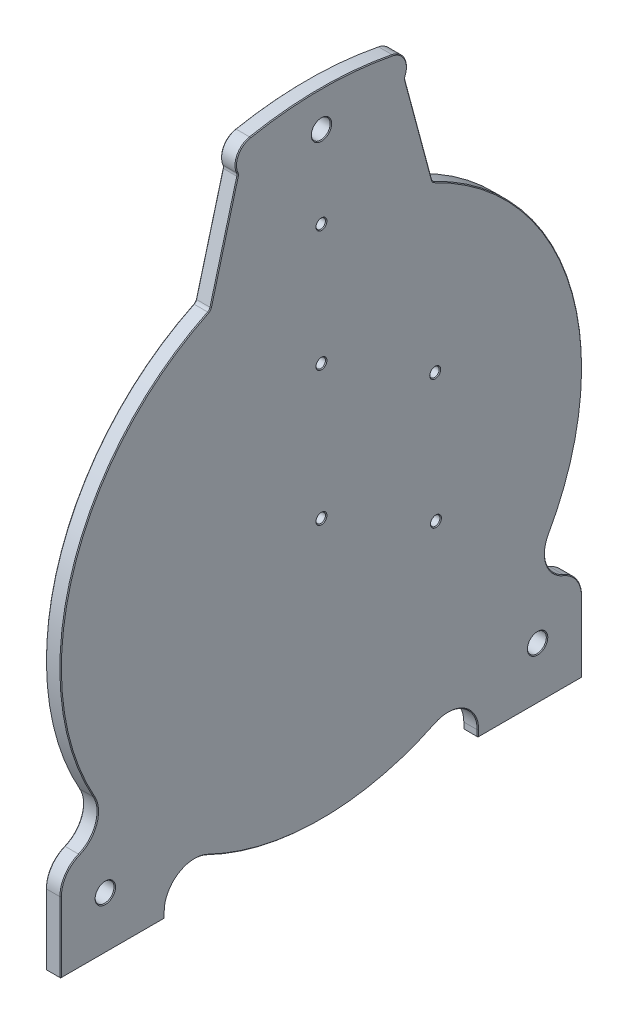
ISO-10303-21;
HEADER;
FILE_DESCRIPTION(('STEP AP214'),'2;1');
FILE_NAME('part.step','',(''),(''),'','','');
FILE_SCHEMA(('AUTOMOTIVE_DESIGN { 1 0 10303 214 1 1 1 1 }'));
ENDSEC;
DATA;
#1=APPLICATION_CONTEXT('core data for automotive mechanical design processes');
#2=APPLICATION_PROTOCOL_DEFINITION('international standard','automotive_design',2000,#1);
#3=PRODUCT_CONTEXT('',#1,'mechanical');
#4=PRODUCT('Part','Part','',(#3));
#5=PRODUCT_RELATED_PRODUCT_CATEGORY('part','',(#4));
#6=PRODUCT_DEFINITION_FORMATION('','',#4);
#7=PRODUCT_DEFINITION_CONTEXT('part definition',#1,'design');
#8=PRODUCT_DEFINITION('design','',#6,#7);
#9=PRODUCT_DEFINITION_SHAPE('','',#8);
#10=(LENGTH_UNIT() NAMED_UNIT(*) SI_UNIT(.MILLI.,.METRE.));
#11=(NAMED_UNIT(*) PLANE_ANGLE_UNIT() SI_UNIT($,.RADIAN.));
#12=(NAMED_UNIT(*) SI_UNIT($,.STERADIAN.) SOLID_ANGLE_UNIT());
#13=UNCERTAINTY_MEASURE_WITH_UNIT(LENGTH_MEASURE(1.E-05),#10,'distance_accuracy_value','');
#14=(GEOMETRIC_REPRESENTATION_CONTEXT(3) GLOBAL_UNCERTAINTY_ASSIGNED_CONTEXT((#13)) GLOBAL_UNIT_ASSIGNED_CONTEXT((#10,
#11,#12)) REPRESENTATION_CONTEXT('',''));
#15=CARTESIAN_POINT('',(0.,0.,0.));
#16=DIRECTION('',(0.,0.,1.));
#17=DIRECTION('',(1.,0.,0.));
#18=AXIS2_PLACEMENT_3D('',#15,#16,#17);
#19=CARTESIAN_POINT('',(10.,233.610252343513,-45.5));
#20=DIRECTION('',(-1.,0.,0.));
#21=DIRECTION('',(0.,0.,1.));
#22=AXIS2_PLACEMENT_3D('',#19,#20,#21);
#23=PLANE('',#22);
#24=CARTESIAN_POINT('',(10.,-145.,-145.));
#25=DIRECTION('',(-1.,0.,0.));
#26=DIRECTION('',(0.,0.,1.));
#27=AXIS2_PLACEMENT_3D('',#24,#25,#26);
#28=CIRCLE('',#27,6.84999999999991);
#29=CARTESIAN_POINT('',(10.,-145.,-138.15));
#30=VERTEX_POINT('',#29);
#31=EDGE_CURVE('E769',#30,#30,#28,.T.);
#32=ORIENTED_EDGE('',*,*,#31,.T.);
#33=EDGE_LOOP('',(#32));
#34=FACE_BOUND('',#33,.T.);
#35=CARTESIAN_POINT('',(10.,-39.9972986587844,-76.81));
#36=DIRECTION('',(-1.,0.,0.));
#37=DIRECTION('',(0.,0.,1.));
#38=AXIS2_PLACEMENT_3D('',#35,#36,#37);
#39=CIRCLE('',#38,3.67499999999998);
#40=CARTESIAN_POINT('',(10.,-39.9972986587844,-73.135));
#41=VERTEX_POINT('',#40);
#42=EDGE_CURVE('E766',#41,#41,#39,.T.);
#43=ORIENTED_EDGE('',*,*,#42,.T.);
#44=EDGE_LOOP('',(#43));
#45=FACE_BOUND('',#44,.T.);
#46=CARTESIAN_POINT('',(10.,226.,0.));
#47=DIRECTION('',(-1.,0.,0.));
#48=DIRECTION('',(0.,0.,1.));
#49=AXIS2_PLACEMENT_3D('',#46,#47,#48);
#50=CIRCLE('',#49,6.84999999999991);
#51=CARTESIAN_POINT('',(10.,226.,6.84999999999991));
#52=VERTEX_POINT('',#51);
#53=EDGE_CURVE('E763',#52,#52,#50,.T.);
#54=ORIENTED_EDGE('',*,*,#53,.T.);
#55=EDGE_LOOP('',(#54));
#56=FACE_BOUND('',#55,.T.);
#57=CARTESIAN_POINT('',(10.,90.,0.));
#58=DIRECTION('',(-1.,0.,0.));
#59=DIRECTION('',(0.,0.,1.));
#60=AXIS2_PLACEMENT_3D('',#57,#58,#59);
#61=CIRCLE('',#60,3.67500000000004);
#62=CARTESIAN_POINT('',(10.,90.,3.67500000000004));
#63=VERTEX_POINT('',#62);
#64=EDGE_CURVE('E760',#63,#63,#61,.T.);
#65=ORIENTED_EDGE('',*,*,#64,.T.);
#66=EDGE_LOOP('',(#65));
#67=FACE_BOUND('',#66,.T.);
#68=CARTESIAN_POINT('',(10.,0.,0.));
#69=DIRECTION('',(-1.,0.,0.));
#70=DIRECTION('',(0.,0.,1.));
#71=AXIS2_PLACEMENT_3D('',#68,#69,#70);
#72=CIRCLE('',#71,174.5);
#73=CARTESIAN_POINT('',(10.,-85.4053414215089,-152.171540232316));
#74=VERTEX_POINT('',#73);
#75=CARTESIAN_POINT('',(10.,157.234450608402,-75.6807607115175));
#76=VERTEX_POINT('',#75);
#77=EDGE_CURVE('E755',#74,#76,#72,.F.);
#78=ORIENTED_EDGE('',*,*,#77,.T.);
#79=CARTESIAN_POINT('',(10.,160.388150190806,-77.1987129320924));
#80=DIRECTION('',(-1.,0.,0.));
#81=DIRECTION('',(0.,0.,1.));
#82=AXIS2_PLACEMENT_3D('',#79,#80,#81);
#83=CIRCLE('',#82,3.50000000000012);
#84=CARTESIAN_POINT('',(10.,159.482283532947,-73.8179725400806));
#85=VERTEX_POINT('',#84);
#86=EDGE_CURVE('E757',#76,#85,#83,.T.);
#87=ORIENTED_EDGE('',*,*,#86,.T.);
#88=DIRECTION('',(0.,0.965925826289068,0.258819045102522));
#89=VECTOR('',#88,1.);
#90=CARTESIAN_POINT('',(10.,235.724113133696,-53.3890358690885));
#91=LINE('',#90,#89);
#92=CARTESIAN_POINT('',(10.,226.61807113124,-55.8289924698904));
#93=VERTEX_POINT('',#92);
#94=EDGE_CURVE('E711',#85,#93,#91,.T.);
#95=ORIENTED_EDGE('',*,*,#94,.T.);
#96=CARTESIAN_POINT('',(10.,227.523937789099,-59.2097328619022));
#97=DIRECTION('',(-1.,0.,0.));
#98=DIRECTION('',(0.,0.,1.));
#99=AXIS2_PLACEMENT_3D('',#96,#97,#98);
#100=CIRCLE('',#99,3.50000000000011);
#101=CARTESIAN_POINT('',(10.,228.944077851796,-56.010795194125));
#102=VERTEX_POINT('',#101);
#103=EDGE_CURVE('E713',#93,#102,#100,.T.);
#104=ORIENTED_EDGE('',*,*,#103,.T.);
#105=CARTESIAN_POINT('',(10.,233.610252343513,-45.5));
#106=DIRECTION('',(-1.,0.,0.));
#107=DIRECTION('',(0.,0.,1.));
#108=AXIS2_PLACEMENT_3D('',#105,#106,#107);
#109=CIRCLE('',#108,11.4999999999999);
#110=CARTESIAN_POINT('',(10.,244.898142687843,-47.6985294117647));
#111=VERTEX_POINT('',#110);
#112=EDGE_CURVE('E715',#102,#111,#109,.F.);
#113=ORIENTED_EDGE('',*,*,#112,.T.);
#114=CARTESIAN_POINT('',(10.,0.,0.));
#115=DIRECTION('',(-1.,0.,0.));
#116=DIRECTION('',(0.,0.,1.));
#117=AXIS2_PLACEMENT_3D('',#114,#115,#116);
#118=CIRCLE('',#117,249.5);
#119=CARTESIAN_POINT('',(10.,244.898142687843,47.6985294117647));
#120=VERTEX_POINT('',#119);
#121=EDGE_CURVE('E717',#111,#120,#118,.F.);
#122=ORIENTED_EDGE('',*,*,#121,.T.);
#123=CARTESIAN_POINT('',(10.,233.610252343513,45.5));
#124=DIRECTION('',(-1.,0.,0.));
#125=DIRECTION('',(0.,0.,1.));
#126=AXIS2_PLACEMENT_3D('',#123,#124,#125);
#127=CIRCLE('',#126,11.4999999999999);
#128=CARTESIAN_POINT('',(10.,228.944077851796,56.0107951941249));
#129=VERTEX_POINT('',#128);
#130=EDGE_CURVE('E719',#120,#129,#127,.F.);
#131=ORIENTED_EDGE('',*,*,#130,.T.);
#132=CARTESIAN_POINT('',(10.,227.523937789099,59.2097328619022));
#133=DIRECTION('',(-1.,0.,0.));
#134=DIRECTION('',(0.,0.,1.));
#135=AXIS2_PLACEMENT_3D('',#132,#133,#134);
#136=CIRCLE('',#135,3.50000000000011);
#137=CARTESIAN_POINT('',(10.,226.61807113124,55.8289924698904));
#138=VERTEX_POINT('',#137);
#139=EDGE_CURVE('E721',#129,#138,#136,.T.);
#140=ORIENTED_EDGE('',*,*,#139,.T.);
#141=DIRECTION('',(0.,-0.965925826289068,0.258819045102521));
#142=VECTOR('',#141,1.);
#143=CARTESIAN_POINT('',(10.,258.474113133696,47.2931917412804));
#144=LINE('',#143,#142);
#145=CARTESIAN_POINT('',(10.,159.482283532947,73.8179725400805));
#146=VERTEX_POINT('',#145);
#147=EDGE_CURVE('E723',#138,#146,#144,.T.);
#148=ORIENTED_EDGE('',*,*,#147,.T.);
#149=CARTESIAN_POINT('',(10.,160.388150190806,77.1987129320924));
#150=DIRECTION('',(-1.,0.,0.));
#151=DIRECTION('',(0.,0.,1.));
#152=AXIS2_PLACEMENT_3D('',#149,#150,#151);
#153=CIRCLE('',#152,3.50000000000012);
#154=CARTESIAN_POINT('',(10.,157.234450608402,75.6807607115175));
#155=VERTEX_POINT('',#154);
#156=EDGE_CURVE('E725',#146,#155,#153,.T.);
#157=ORIENTED_EDGE('',*,*,#156,.T.);
#158=CARTESIAN_POINT('',(10.,0.,0.));
#159=DIRECTION('',(-1.,0.,0.));
#160=DIRECTION('',(0.,0.,1.));
#161=AXIS2_PLACEMENT_3D('',#158,#159,#160);
#162=CIRCLE('',#161,174.5);
#163=CARTESIAN_POINT('',(10.,-85.4053414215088,152.171540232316));
#164=VERTEX_POINT('',#163);
#165=EDGE_CURVE('E727',#155,#164,#162,.F.);
#166=ORIENTED_EDGE('',*,*,#165,.T.);
#167=CARTESIAN_POINT('',(10.,-95.4386336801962,170.048426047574));
#168=DIRECTION('',(-1.,0.,0.));
#169=DIRECTION('',(0.,0.,1.));
#170=AXIS2_PLACEMENT_3D('',#167,#168,#169);
#171=CIRCLE('',#170,20.5000000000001);
#172=CARTESIAN_POINT('',(10.,-114.432583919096,162.336107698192));
#173=VERTEX_POINT('',#172);
#174=EDGE_CURVE('E729',#164,#173,#171,.T.);
#175=ORIENTED_EDGE('',*,*,#174,.T.);
#176=CARTESIAN_POINT('',(10.,-132.5,155.));
#177=DIRECTION('',(-1.,0.,0.));
#178=DIRECTION('',(0.,0.,1.));
#179=AXIS2_PLACEMENT_3D('',#176,#177,#178);
#180=CIRCLE('',#179,19.4999999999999);
#181=CARTESIAN_POINT('',(10.,-132.5,174.5));
#182=VERTEX_POINT('',#181);
#183=EDGE_CURVE('E731',#173,#182,#180,.F.);
#184=ORIENTED_EDGE('',*,*,#183,.T.);
#185=DIRECTION('',(0.,-1.,0.));
#186=VECTOR('',#185,1.);
#187=CARTESIAN_POINT('',(10.,233.610252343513,174.5));
#188=LINE('',#187,#186);
#189=CARTESIAN_POINT('',(10.,-179.5,174.5));
#190=VERTEX_POINT('',#189);
#191=EDGE_CURVE('E733',#182,#190,#188,.T.);
#192=ORIENTED_EDGE('',*,*,#191,.T.);
#193=DIRECTION('',(0.,0.,-1.));
#194=VECTOR('',#193,1.);
#195=CARTESIAN_POINT('',(10.,-179.5,-45.5000000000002));
#196=LINE('',#195,#194);
#197=CARTESIAN_POINT('',(10.,-179.5,105.5));
#198=VERTEX_POINT('',#197);
#199=EDGE_CURVE('E735',#190,#198,#196,.T.);
#200=ORIENTED_EDGE('',*,*,#199,.T.);
#201=DIRECTION('',(0.,1.,0.));
#202=VECTOR('',#201,1.);
#203=CARTESIAN_POINT('',(10.,233.610252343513,105.5));
#204=LINE('',#203,#202);
#205=CARTESIAN_POINT('',(10.,-175.499287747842,105.5));
#206=VERTEX_POINT('',#205);
#207=EDGE_CURVE('E737',#198,#206,#204,.T.);
#208=ORIENTED_EDGE('',*,*,#207,.T.);
#209=CARTESIAN_POINT('',(10.,-175.499287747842,84.9999999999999));
#210=DIRECTION('',(-1.,0.,0.));
#211=DIRECTION('',(0.,0.,1.));
#212=AXIS2_PLACEMENT_3D('',#209,#210,#211);
#213=CIRCLE('',#212,20.5000000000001);
#214=CARTESIAN_POINT('',(10.,-157.049362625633,76.0641025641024));
#215=VERTEX_POINT('',#214);
#216=EDGE_CURVE('E739',#206,#215,#213,.T.);
#217=ORIENTED_EDGE('',*,*,#216,.T.);
#218=CARTESIAN_POINT('',(10.,0.,0.));
#219=DIRECTION('',(-1.,0.,0.));
#220=DIRECTION('',(0.,0.,1.));
#221=AXIS2_PLACEMENT_3D('',#218,#219,#220);
#222=CIRCLE('',#221,174.5);
#223=CARTESIAN_POINT('',(10.,-157.049362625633,-76.0641025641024));
#224=VERTEX_POINT('',#223);
#225=EDGE_CURVE('E741',#215,#224,#222,.F.);
#226=ORIENTED_EDGE('',*,*,#225,.T.);
#227=CARTESIAN_POINT('',(10.,-175.499287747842,-84.9999999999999));
#228=DIRECTION('',(-1.,0.,0.));
#229=DIRECTION('',(0.,0.,1.));
#230=AXIS2_PLACEMENT_3D('',#227,#228,#229);
#231=CIRCLE('',#230,20.5000000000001);
#232=CARTESIAN_POINT('',(10.,-175.499287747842,-105.5));
#233=VERTEX_POINT('',#232);
#234=EDGE_CURVE('E743',#224,#233,#231,.T.);
#235=ORIENTED_EDGE('',*,*,#234,.T.);
#236=DIRECTION('',(0.,-1.,0.));
#237=VECTOR('',#236,1.);
#238=CARTESIAN_POINT('',(10.,233.610252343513,-105.5));
#239=LINE('',#238,#237);
#240=CARTESIAN_POINT('',(10.,-179.5,-105.5));
#241=VERTEX_POINT('',#240);
#242=EDGE_CURVE('E745',#233,#241,#239,.T.);
#243=ORIENTED_EDGE('',*,*,#242,.T.);
#244=DIRECTION('',(0.,0.,-1.));
#245=VECTOR('',#244,1.);
#246=CARTESIAN_POINT('',(10.,-179.5,-45.4999999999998));
#247=LINE('',#246,#245);
#248=CARTESIAN_POINT('',(10.,-179.5,-174.5));
#249=VERTEX_POINT('',#248);
#250=EDGE_CURVE('E747',#241,#249,#247,.T.);
#251=ORIENTED_EDGE('',*,*,#250,.T.);
#252=DIRECTION('',(0.,1.,0.));
#253=VECTOR('',#252,1.);
#254=CARTESIAN_POINT('',(10.,233.610252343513,-174.5));
#255=LINE('',#254,#253);
#256=CARTESIAN_POINT('',(10.,-132.5,-174.5));
#257=VERTEX_POINT('',#256);
#258=EDGE_CURVE('E749',#249,#257,#255,.T.);
#259=ORIENTED_EDGE('',*,*,#258,.T.);
#260=CARTESIAN_POINT('',(10.,-132.5,-155.));
#261=DIRECTION('',(-1.,0.,0.));
#262=DIRECTION('',(0.,0.,1.));
#263=AXIS2_PLACEMENT_3D('',#260,#261,#262);
#264=CIRCLE('',#263,19.4999999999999);
#265=CARTESIAN_POINT('',(10.,-114.432583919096,-162.336107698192));
#266=VERTEX_POINT('',#265);
#267=EDGE_CURVE('E751',#257,#266,#264,.F.);
#268=ORIENTED_EDGE('',*,*,#267,.T.);
#269=CARTESIAN_POINT('',(10.,-95.4386336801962,-170.048426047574));
#270=DIRECTION('',(-1.,0.,0.));
#271=DIRECTION('',(0.,0.,1.));
#272=AXIS2_PLACEMENT_3D('',#269,#270,#271);
#273=CIRCLE('',#272,20.5000000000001);
#274=EDGE_CURVE('E753',#266,#74,#273,.T.);
#275=ORIENTED_EDGE('',*,*,#274,.T.);
#276=EDGE_LOOP('',(#78,#87,#95,#104,#113,#122,#131,#140,#148,#157,#166,#175,#184,#192,#200,#208,
#217,#226,#235,#243,#251,#259,#268,#275));
#277=FACE_BOUND('',#276,.T.);
#278=CARTESIAN_POINT('',(10.,0.,0.));
#279=DIRECTION('',(-1.,0.,0.));
#280=DIRECTION('',(0.,0.,1.));
#281=AXIS2_PLACEMENT_3D('',#278,#279,#280);
#282=CIRCLE('',#281,3.67499999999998);
#283=CARTESIAN_POINT('',(10.,0.,3.67499999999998));
#284=VERTEX_POINT('',#283);
#285=EDGE_CURVE('E708',#284,#284,#282,.T.);
#286=ORIENTED_EDGE('',*,*,#285,.T.);
#287=EDGE_LOOP('',(#286));
#288=FACE_BOUND('',#287,.T.);
#289=CARTESIAN_POINT('',(10.,171.,0.));
#290=DIRECTION('',(-1.,0.,0.));
#291=DIRECTION('',(0.,0.,1.));
#292=AXIS2_PLACEMENT_3D('',#289,#290,#291);
#293=CIRCLE('',#292,3.67500000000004);
#294=CARTESIAN_POINT('',(10.,171.,3.67500000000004));
#295=VERTEX_POINT('',#294);
#296=EDGE_CURVE('E705',#295,#295,#293,.T.);
#297=ORIENTED_EDGE('',*,*,#296,.T.);
#298=EDGE_LOOP('',(#297));
#299=FACE_BOUND('',#298,.T.);
#300=CARTESIAN_POINT('',(10.,46.6152603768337,-76.32));
#301=DIRECTION('',(-1.,0.,0.));
#302=DIRECTION('',(0.,0.,1.));
#303=AXIS2_PLACEMENT_3D('',#300,#301,#302);
#304=CIRCLE('',#303,3.67500000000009);
#305=CARTESIAN_POINT('',(10.,46.6152603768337,-72.6449999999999));
#306=VERTEX_POINT('',#305);
#307=EDGE_CURVE('E702',#306,#306,#304,.T.);
#308=ORIENTED_EDGE('',*,*,#307,.T.);
#309=EDGE_LOOP('',(#308));
#310=FACE_BOUND('',#309,.T.);
#311=CARTESIAN_POINT('',(10.,-145.,145.));
#312=DIRECTION('',(-1.,0.,0.));
#313=DIRECTION('',(0.,0.,1.));
#314=AXIS2_PLACEMENT_3D('',#311,#312,#313);
#315=CIRCLE('',#314,6.84999999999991);
#316=CARTESIAN_POINT('',(10.,-145.,151.85));
#317=VERTEX_POINT('',#316);
#318=EDGE_CURVE('E699',#317,#317,#315,.T.);
#319=ORIENTED_EDGE('',*,*,#318,.T.);
#320=EDGE_LOOP('',(#319));
#321=FACE_BOUND('',#320,.T.);
#322=ADVANCED_FACE('F31',(#34,#45,#56,#67,#277,#288,#299,#310,#321),#23,.F.);
#323=CARTESIAN_POINT('',(0.,233.610252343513,-45.5));
#324=DIRECTION('',(-1.,0.,0.));
#325=DIRECTION('',(0.,0.,1.));
#326=AXIS2_PLACEMENT_3D('',#323,#324,#325);
#327=PLANE('',#326);
#328=CARTESIAN_POINT('',(0.,-145.,-145.));
#329=DIRECTION('',(-1.,0.,0.));
#330=DIRECTION('',(0.,0.,1.));
#331=AXIS2_PLACEMENT_3D('',#328,#329,#330);
#332=CIRCLE('',#331,6.84999999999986);
#333=CARTESIAN_POINT('',(0.,-145.,-138.15));
#334=VERTEX_POINT('',#333);
#335=EDGE_CURVE('E648',#334,#334,#332,.F.);
#336=ORIENTED_EDGE('',*,*,#335,.T.);
#337=EDGE_LOOP('',(#336));
#338=FACE_BOUND('',#337,.T.);
#339=CARTESIAN_POINT('',(0.,-39.9972986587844,-76.81));
#340=DIRECTION('',(-1.,0.,0.));
#341=DIRECTION('',(0.,0.,1.));
#342=AXIS2_PLACEMENT_3D('',#339,#340,#341);
#343=CIRCLE('',#342,3.67499999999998);
#344=CARTESIAN_POINT('',(0.,-39.9972986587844,-73.135));
#345=VERTEX_POINT('',#344);
#346=EDGE_CURVE('E645',#345,#345,#343,.F.);
#347=ORIENTED_EDGE('',*,*,#346,.T.);
#348=EDGE_LOOP('',(#347));
#349=FACE_BOUND('',#348,.T.);
#350=CARTESIAN_POINT('',(0.,226.,0.));
#351=DIRECTION('',(-1.,0.,0.));
#352=DIRECTION('',(0.,0.,1.));
#353=AXIS2_PLACEMENT_3D('',#350,#351,#352);
#354=CIRCLE('',#353,6.85000000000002);
#355=CARTESIAN_POINT('',(0.,226.,6.85000000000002));
#356=VERTEX_POINT('',#355);
#357=EDGE_CURVE('E642',#356,#356,#354,.F.);
#358=ORIENTED_EDGE('',*,*,#357,.T.);
#359=EDGE_LOOP('',(#358));
#360=FACE_BOUND('',#359,.T.);
#361=CARTESIAN_POINT('',(0.,90.,0.));
#362=DIRECTION('',(-1.,0.,0.));
#363=DIRECTION('',(0.,0.,1.));
#364=AXIS2_PLACEMENT_3D('',#361,#362,#363);
#365=CIRCLE('',#364,3.67499999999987);
#366=CARTESIAN_POINT('',(0.,90.,3.67499999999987));
#367=VERTEX_POINT('',#366);
#368=EDGE_CURVE('E639',#367,#367,#365,.F.);
#369=ORIENTED_EDGE('',*,*,#368,.T.);
#370=EDGE_LOOP('',(#369));
#371=FACE_BOUND('',#370,.T.);
#372=CARTESIAN_POINT('',(0.,0.,0.));
#373=DIRECTION('',(-1.,0.,0.));
#374=DIRECTION('',(0.,0.,1.));
#375=AXIS2_PLACEMENT_3D('',#372,#373,#374);
#376=CIRCLE('',#375,3.67499999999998);
#377=CARTESIAN_POINT('',(0.,0.,3.67499999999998));
#378=VERTEX_POINT('',#377);
#379=EDGE_CURVE('E636',#378,#378,#376,.F.);
#380=ORIENTED_EDGE('',*,*,#379,.T.);
#381=EDGE_LOOP('',(#380));
#382=FACE_BOUND('',#381,.T.);
#383=CARTESIAN_POINT('',(0.,171.,0.));
#384=DIRECTION('',(-1.,0.,0.));
#385=DIRECTION('',(0.,0.,1.));
#386=AXIS2_PLACEMENT_3D('',#383,#384,#385);
#387=CIRCLE('',#386,3.67499999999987);
#388=CARTESIAN_POINT('',(0.,171.,3.67499999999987));
#389=VERTEX_POINT('',#388);
#390=EDGE_CURVE('E633',#389,#389,#387,.F.);
#391=ORIENTED_EDGE('',*,*,#390,.T.);
#392=EDGE_LOOP('',(#391));
#393=FACE_BOUND('',#392,.T.);
#394=CARTESIAN_POINT('',(0.,46.6152603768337,-76.32));
#395=DIRECTION('',(-1.,0.,0.));
#396=DIRECTION('',(0.,0.,1.));
#397=AXIS2_PLACEMENT_3D('',#394,#395,#396);
#398=CIRCLE('',#397,3.67500000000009);
#399=CARTESIAN_POINT('',(0.,46.6152603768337,-72.6449999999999));
#400=VERTEX_POINT('',#399);
#401=EDGE_CURVE('E630',#400,#400,#398,.F.);
#402=ORIENTED_EDGE('',*,*,#401,.T.);
#403=EDGE_LOOP('',(#402));
#404=FACE_BOUND('',#403,.T.);
#405=CARTESIAN_POINT('',(0.,-145.,145.));
#406=DIRECTION('',(-1.,0.,0.));
#407=DIRECTION('',(0.,0.,1.));
#408=AXIS2_PLACEMENT_3D('',#405,#406,#407);
#409=CIRCLE('',#408,6.84999999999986);
#410=CARTESIAN_POINT('',(0.,-145.,151.85));
#411=VERTEX_POINT('',#410);
#412=EDGE_CURVE('E627',#411,#411,#409,.F.);
#413=ORIENTED_EDGE('',*,*,#412,.T.);
#414=EDGE_LOOP('',(#413));
#415=FACE_BOUND('',#414,.T.);
#416=CARTESIAN_POINT('',(0.,233.610252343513,45.5));
#417=DIRECTION('',(-1.,0.,0.));
#418=DIRECTION('',(0.,0.,1.));
#419=AXIS2_PLACEMENT_3D('',#416,#417,#418);
#420=CIRCLE('',#419,11.4999999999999);
#421=CARTESIAN_POINT('',(0.,228.944077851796,56.0107951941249));
#422=VERTEX_POINT('',#421);
#423=CARTESIAN_POINT('',(0.,244.898142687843,47.6985294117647));
#424=VERTEX_POINT('',#423);
#425=EDGE_CURVE('E622',#422,#424,#420,.T.);
#426=ORIENTED_EDGE('',*,*,#425,.T.);
#427=CARTESIAN_POINT('',(0.,0.,0.));
#428=DIRECTION('',(-1.,0.,0.));
#429=DIRECTION('',(0.,0.,1.));
#430=AXIS2_PLACEMENT_3D('',#427,#428,#429);
#431=CIRCLE('',#430,249.5);
#432=CARTESIAN_POINT('',(0.,244.898142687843,-47.6985294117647));
#433=VERTEX_POINT('',#432);
#434=EDGE_CURVE('E624',#424,#433,#431,.T.);
#435=ORIENTED_EDGE('',*,*,#434,.T.);
#436=CARTESIAN_POINT('',(0.,233.610252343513,-45.5));
#437=DIRECTION('',(-1.,0.,0.));
#438=DIRECTION('',(0.,0.,1.));
#439=AXIS2_PLACEMENT_3D('',#436,#437,#438);
#440=CIRCLE('',#439,11.4999999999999);
#441=CARTESIAN_POINT('',(0.,228.944077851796,-56.0107951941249));
#442=VERTEX_POINT('',#441);
#443=EDGE_CURVE('E604',#433,#442,#440,.T.);
#444=ORIENTED_EDGE('',*,*,#443,.T.);
#445=CARTESIAN_POINT('',(0.,227.523937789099,-59.2097328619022));
#446=DIRECTION('',(-1.,0.,0.));
#447=DIRECTION('',(0.,0.,1.));
#448=AXIS2_PLACEMENT_3D('',#445,#446,#447);
#449=CIRCLE('',#448,3.50000000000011);
#450=CARTESIAN_POINT('',(0.,226.61807113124,-55.8289924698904));
#451=VERTEX_POINT('',#450);
#452=EDGE_CURVE('E602',#442,#451,#449,.F.);
#453=ORIENTED_EDGE('',*,*,#452,.T.);
#454=DIRECTION('',(0.,-0.965925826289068,-0.258819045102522));
#455=VECTOR('',#454,1.);
#456=CARTESIAN_POINT('',(0.,159.482283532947,-73.8179725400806));
#457=LINE('',#456,#455);
#458=CARTESIAN_POINT('',(0.,159.482283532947,-73.8179725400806));
#459=VERTEX_POINT('',#458);
#460=EDGE_CURVE('E600',#451,#459,#457,.T.);
#461=ORIENTED_EDGE('',*,*,#460,.T.);
#462=CARTESIAN_POINT('',(0.,160.388150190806,-77.1987129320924));
#463=DIRECTION('',(-1.,0.,0.));
#464=DIRECTION('',(0.,0.,1.));
#465=AXIS2_PLACEMENT_3D('',#462,#463,#464);
#466=CIRCLE('',#465,3.50000000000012);
#467=CARTESIAN_POINT('',(0.,157.234450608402,-75.6807607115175));
#468=VERTEX_POINT('',#467);
#469=EDGE_CURVE('E598',#459,#468,#466,.F.);
#470=ORIENTED_EDGE('',*,*,#469,.T.);
#471=CARTESIAN_POINT('',(0.,0.,0.));
#472=DIRECTION('',(-1.,0.,0.));
#473=DIRECTION('',(0.,0.,1.));
#474=AXIS2_PLACEMENT_3D('',#471,#472,#473);
#475=CIRCLE('',#474,174.5);
#476=CARTESIAN_POINT('',(0.,-85.4053414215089,-152.171540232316));
#477=VERTEX_POINT('',#476);
#478=EDGE_CURVE('E596',#468,#477,#475,.T.);
#479=ORIENTED_EDGE('',*,*,#478,.T.);
#480=CARTESIAN_POINT('',(0.,-95.4386336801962,-170.048426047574));
#481=DIRECTION('',(-1.,0.,0.));
#482=DIRECTION('',(0.,0.,1.));
#483=AXIS2_PLACEMENT_3D('',#480,#481,#482);
#484=CIRCLE('',#483,20.5000000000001);
#485=CARTESIAN_POINT('',(0.,-114.432583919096,-162.336107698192));
#486=VERTEX_POINT('',#485);
#487=EDGE_CURVE('E594',#477,#486,#484,.F.);
#488=ORIENTED_EDGE('',*,*,#487,.T.);
#489=CARTESIAN_POINT('',(0.,-132.5,-155.));
#490=DIRECTION('',(-1.,0.,0.));
#491=DIRECTION('',(0.,0.,1.));
#492=AXIS2_PLACEMENT_3D('',#489,#490,#491);
#493=CIRCLE('',#492,19.4999999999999);
#494=CARTESIAN_POINT('',(0.,-132.5,-174.5));
#495=VERTEX_POINT('',#494);
#496=EDGE_CURVE('E592',#486,#495,#493,.T.);
#497=ORIENTED_EDGE('',*,*,#496,.T.);
#498=DIRECTION('',(0.,-1.,0.));
#499=VECTOR('',#498,1.);
#500=CARTESIAN_POINT('',(0.,-180.,-174.5));
#501=LINE('',#500,#499);
#502=CARTESIAN_POINT('',(0.,-179.5,-174.5));
#503=VERTEX_POINT('',#502);
#504=EDGE_CURVE('E590',#495,#503,#501,.T.);
#505=ORIENTED_EDGE('',*,*,#504,.T.);
#506=DIRECTION('',(0.,0.,1.));
#507=VECTOR('',#506,1.);
#508=CARTESIAN_POINT('',(0.,-179.5,-105.));
#509=LINE('',#508,#507);
#510=CARTESIAN_POINT('',(0.,-179.5,-105.5));
#511=VERTEX_POINT('',#510);
#512=EDGE_CURVE('E588',#503,#511,#509,.T.);
#513=ORIENTED_EDGE('',*,*,#512,.T.);
#514=DIRECTION('',(0.,1.,0.));
#515=VECTOR('',#514,1.);
#516=CARTESIAN_POINT('',(0.,-175.499287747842,-105.5));
#517=LINE('',#516,#515);
#518=CARTESIAN_POINT('',(0.,-175.499287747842,-105.5));
#519=VERTEX_POINT('',#518);
#520=EDGE_CURVE('E586',#511,#519,#517,.T.);
#521=ORIENTED_EDGE('',*,*,#520,.T.);
#522=CARTESIAN_POINT('',(0.,-175.499287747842,-84.9999999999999));
#523=DIRECTION('',(-1.,0.,0.));
#524=DIRECTION('',(0.,0.,1.));
#525=AXIS2_PLACEMENT_3D('',#522,#523,#524);
#526=CIRCLE('',#525,20.5000000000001);
#527=CARTESIAN_POINT('',(0.,-157.049362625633,-76.0641025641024));
#528=VERTEX_POINT('',#527);
#529=EDGE_CURVE('E584',#519,#528,#526,.F.);
#530=ORIENTED_EDGE('',*,*,#529,.T.);
#531=CARTESIAN_POINT('',(0.,0.,0.));
#532=DIRECTION('',(-1.,0.,0.));
#533=DIRECTION('',(0.,0.,1.));
#534=AXIS2_PLACEMENT_3D('',#531,#532,#533);
#535=CIRCLE('',#534,174.5);
#536=CARTESIAN_POINT('',(0.,-157.049362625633,76.0641025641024));
#537=VERTEX_POINT('',#536);
#538=EDGE_CURVE('E364',#528,#537,#535,.T.);
#539=ORIENTED_EDGE('',*,*,#538,.T.);
#540=CARTESIAN_POINT('',(0.,-175.499287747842,84.9999999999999));
#541=DIRECTION('',(-1.,0.,0.));
#542=DIRECTION('',(0.,0.,1.));
#543=AXIS2_PLACEMENT_3D('',#540,#541,#542);
#544=CIRCLE('',#543,20.5000000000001);
#545=CARTESIAN_POINT('',(0.,-175.499287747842,105.5));
#546=VERTEX_POINT('',#545);
#547=EDGE_CURVE('E358',#537,#546,#544,.F.);
#548=ORIENTED_EDGE('',*,*,#547,.T.);
#549=DIRECTION('',(0.,-1.,0.));
#550=VECTOR('',#549,1.);
#551=CARTESIAN_POINT('',(0.,-180.,105.5));
#552=LINE('',#551,#550);
#553=CARTESIAN_POINT('',(0.,-179.5,105.5));
#554=VERTEX_POINT('',#553);
#555=EDGE_CURVE('E361',#546,#554,#552,.T.);
#556=ORIENTED_EDGE('',*,*,#555,.T.);
#557=DIRECTION('',(0.,0.,1.));
#558=VECTOR('',#557,1.);
#559=CARTESIAN_POINT('',(0.,-179.5,175.));
#560=LINE('',#559,#558);
#561=CARTESIAN_POINT('',(0.,-179.5,174.5));
#562=VERTEX_POINT('',#561);
#563=EDGE_CURVE('E606',#554,#562,#560,.T.);
#564=ORIENTED_EDGE('',*,*,#563,.T.);
#565=DIRECTION('',(0.,1.,0.));
#566=VECTOR('',#565,1.);
#567=CARTESIAN_POINT('',(0.,-132.5,174.5));
#568=LINE('',#567,#566);
#569=CARTESIAN_POINT('',(0.,-132.5,174.5));
#570=VERTEX_POINT('',#569);
#571=EDGE_CURVE('E608',#562,#570,#568,.T.);
#572=ORIENTED_EDGE('',*,*,#571,.T.);
#573=CARTESIAN_POINT('',(0.,-132.5,155.));
#574=DIRECTION('',(-1.,0.,0.));
#575=DIRECTION('',(0.,0.,1.));
#576=AXIS2_PLACEMENT_3D('',#573,#574,#575);
#577=CIRCLE('',#576,19.4999999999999);
#578=CARTESIAN_POINT('',(0.,-114.432583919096,162.336107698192));
#579=VERTEX_POINT('',#578);
#580=EDGE_CURVE('E610',#570,#579,#577,.T.);
#581=ORIENTED_EDGE('',*,*,#580,.T.);
#582=CARTESIAN_POINT('',(0.,-95.4386336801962,170.048426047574));
#583=DIRECTION('',(-1.,0.,0.));
#584=DIRECTION('',(0.,0.,1.));
#585=AXIS2_PLACEMENT_3D('',#582,#583,#584);
#586=CIRCLE('',#585,20.5000000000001);
#587=CARTESIAN_POINT('',(0.,-85.4053414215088,152.171540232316));
#588=VERTEX_POINT('',#587);
#589=EDGE_CURVE('E612',#579,#588,#586,.F.);
#590=ORIENTED_EDGE('',*,*,#589,.T.);
#591=CARTESIAN_POINT('',(0.,0.,0.));
#592=DIRECTION('',(-1.,0.,0.));
#593=DIRECTION('',(0.,0.,1.));
#594=AXIS2_PLACEMENT_3D('',#591,#592,#593);
#595=CIRCLE('',#594,174.5);
#596=CARTESIAN_POINT('',(0.,157.234450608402,75.6807607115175));
#597=VERTEX_POINT('',#596);
#598=EDGE_CURVE('E614',#588,#597,#595,.T.);
#599=ORIENTED_EDGE('',*,*,#598,.T.);
#600=CARTESIAN_POINT('',(0.,160.388150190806,77.1987129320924));
#601=DIRECTION('',(-1.,0.,0.));
#602=DIRECTION('',(0.,0.,1.));
#603=AXIS2_PLACEMENT_3D('',#600,#601,#602);
#604=CIRCLE('',#603,3.50000000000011);
#605=CARTESIAN_POINT('',(0.,159.482283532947,73.8179725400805));
#606=VERTEX_POINT('',#605);
#607=EDGE_CURVE('E616',#597,#606,#604,.F.);
#608=ORIENTED_EDGE('',*,*,#607,.T.);
#609=DIRECTION('',(0.,0.965925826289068,-0.258819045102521));
#610=VECTOR('',#609,1.);
#611=CARTESIAN_POINT('',(0.,226.61807113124,55.8289924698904));
#612=LINE('',#611,#610);
#613=CARTESIAN_POINT('',(0.,226.61807113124,55.8289924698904));
#614=VERTEX_POINT('',#613);
#615=EDGE_CURVE('E618',#606,#614,#612,.T.);
#616=ORIENTED_EDGE('',*,*,#615,.T.);
#617=CARTESIAN_POINT('',(0.,227.523937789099,59.2097328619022));
#618=DIRECTION('',(-1.,0.,0.));
#619=DIRECTION('',(0.,0.,1.));
#620=AXIS2_PLACEMENT_3D('',#617,#618,#619);
#621=CIRCLE('',#620,3.50000000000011);
#622=EDGE_CURVE('E620',#614,#422,#621,.F.);
#623=ORIENTED_EDGE('',*,*,#622,.T.);
#624=EDGE_LOOP('',(#426,#435,#444,#453,#461,#470,#479,#488,#497,#505,#513,#521,#530,#539,#548,
#556,#564,#572,#581,#590,#599,#608,#616,#623));
#625=FACE_BOUND('',#624,.T.);
#626=ADVANCED_FACE('F360',(#338,#349,#360,#371,#382,#393,#404,#415,#625),#327,.T.);
#627=CARTESIAN_POINT('',(10.,233.610252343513,-45.5));
#628=DIRECTION('',(-1.,0.,0.));
#629=DIRECTION('',(0.,0.,1.));
#630=AXIS2_PLACEMENT_3D('',#627,#628,#629);
#631=CYLINDRICAL_SURFACE('',#630,12.);
#632=DIRECTION('',(-1.,0.,0.));
#633=VECTOR('',#632,1.);
#634=CARTESIAN_POINT('',(10.,228.741200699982,-56.4677862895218));
#635=LINE('',#634,#633);
#636=CARTESIAN_POINT('',(9.49999999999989,228.741200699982,-56.4677862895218));
#637=VERTEX_POINT('',#636);
#638=CARTESIAN_POINT('',(0.500000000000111,228.741200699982,-56.4677862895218));
#639=VERTEX_POINT('',#638);
#640=EDGE_CURVE('E560',#637,#639,#635,.T.);
#641=ORIENTED_EDGE('',*,*,#640,.T.);
#642=CARTESIAN_POINT('',(0.500000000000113,233.610252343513,-45.5));
#643=DIRECTION('',(-1.,0.,0.));
#644=DIRECTION('',(0.,0.,1.));
#645=AXIS2_PLACEMENT_3D('',#642,#643,#644);
#646=CIRCLE('',#645,12.);
#647=CARTESIAN_POINT('',(0.500000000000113,245.388920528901,-47.7941176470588));
#648=VERTEX_POINT('',#647);
#649=EDGE_CURVE('E844',#639,#648,#646,.F.);
#650=ORIENTED_EDGE('',*,*,#649,.T.);
#651=DIRECTION('',(-1.,0.,0.));
#652=VECTOR('',#651,1.);
#653=CARTESIAN_POINT('',(10.,245.388920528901,-47.7941176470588));
#654=LINE('',#653,#652);
#655=CARTESIAN_POINT('',(9.49999999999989,245.388920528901,-47.7941176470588));
#656=VERTEX_POINT('',#655);
#657=EDGE_CURVE('E557',#656,#648,#654,.T.);
#658=ORIENTED_EDGE('',*,*,#657,.F.);
#659=CARTESIAN_POINT('',(9.49999999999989,233.610252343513,-45.5));
#660=DIRECTION('',(-1.,0.,0.));
#661=DIRECTION('',(0.,0.,1.));
#662=AXIS2_PLACEMENT_3D('',#659,#660,#661);
#663=CIRCLE('',#662,12.);
#664=EDGE_CURVE('E842',#656,#637,#663,.T.);
#665=ORIENTED_EDGE('',*,*,#664,.T.);
#666=EDGE_LOOP('',(#641,#650,#658,#665));
#667=FACE_BOUND('',#666,.T.);
#668=ADVANCED_FACE('F1067',(#667),#631,.T.);
#669=CARTESIAN_POINT('',(10.,0.,0.));
#670=DIRECTION('',(-1.,0.,0.));
#671=DIRECTION('',(0.,0.,1.));
#672=AXIS2_PLACEMENT_3D('',#669,#670,#671);
#673=CYLINDRICAL_SURFACE('',#672,250.);
#674=ORIENTED_EDGE('',*,*,#657,.T.);
#675=CARTESIAN_POINT('',(0.500000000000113,0.,0.));
#676=DIRECTION('',(-1.,0.,0.));
#677=DIRECTION('',(0.,0.,1.));
#678=AXIS2_PLACEMENT_3D('',#675,#676,#677);
#679=CIRCLE('',#678,250.);
#680=CARTESIAN_POINT('',(0.500000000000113,245.388920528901,47.7941176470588));
#681=VERTEX_POINT('',#680);
#682=EDGE_CURVE('E812',#648,#681,#679,.F.);
#683=ORIENTED_EDGE('',*,*,#682,.T.);
#684=DIRECTION('',(-1.,0.,0.));
#685=VECTOR('',#684,1.);
#686=CARTESIAN_POINT('',(10.,245.388920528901,47.7941176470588));
#687=LINE('',#686,#685);
#688=CARTESIAN_POINT('',(9.49999999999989,245.388920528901,47.7941176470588));
#689=VERTEX_POINT('',#688);
#690=EDGE_CURVE('E554',#689,#681,#687,.T.);
#691=ORIENTED_EDGE('',*,*,#690,.F.);
#692=CARTESIAN_POINT('',(9.49999999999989,0.,0.));
#693=DIRECTION('',(-1.,0.,0.));
#694=DIRECTION('',(0.,0.,1.));
#695=AXIS2_PLACEMENT_3D('',#692,#693,#694);
#696=CIRCLE('',#695,250.);
#697=EDGE_CURVE('E810',#689,#656,#696,.T.);
#698=ORIENTED_EDGE('',*,*,#697,.T.);
#699=EDGE_LOOP('',(#674,#683,#691,#698));
#700=FACE_BOUND('',#699,.T.);
#701=ADVANCED_FACE('F1139',(#700),#673,.T.);
#702=CARTESIAN_POINT('',(10.,233.610252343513,45.5));
#703=DIRECTION('',(-1.,0.,0.));
#704=DIRECTION('',(0.,0.,1.));
#705=AXIS2_PLACEMENT_3D('',#702,#703,#704);
#706=CYLINDRICAL_SURFACE('',#705,12.);
#707=ORIENTED_EDGE('',*,*,#690,.T.);
#708=CARTESIAN_POINT('',(0.500000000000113,233.610252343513,45.5));
#709=DIRECTION('',(-1.,0.,0.));
#710=DIRECTION('',(0.,0.,1.));
#711=AXIS2_PLACEMENT_3D('',#708,#709,#710);
#712=CIRCLE('',#711,12.);
#713=CARTESIAN_POINT('',(0.500000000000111,228.741200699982,56.4677862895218));
#714=VERTEX_POINT('',#713);
#715=EDGE_CURVE('E816',#681,#714,#712,.F.);
#716=ORIENTED_EDGE('',*,*,#715,.T.);
#717=DIRECTION('',(-1.,0.,0.));
#718=VECTOR('',#717,1.);
#719=CARTESIAN_POINT('',(10.,228.741200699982,56.4677862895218));
#720=LINE('',#719,#718);
#721=CARTESIAN_POINT('',(9.49999999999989,228.741200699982,56.4677862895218));
#722=VERTEX_POINT('',#721);
#723=EDGE_CURVE('E578',#714,#722,#720,.F.);
#724=ORIENTED_EDGE('',*,*,#723,.T.);
#725=CARTESIAN_POINT('',(9.49999999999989,233.610252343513,45.5));
#726=DIRECTION('',(-1.,0.,0.));
#727=DIRECTION('',(0.,0.,1.));
#728=AXIS2_PLACEMENT_3D('',#725,#726,#727);
#729=CIRCLE('',#728,12.);
#730=EDGE_CURVE('E814',#722,#689,#729,.T.);
#731=ORIENTED_EDGE('',*,*,#730,.T.);
#732=EDGE_LOOP('',(#707,#716,#724,#731));
#733=FACE_BOUND('',#732,.T.);
#734=ADVANCED_FACE('F994',(#733),#706,.T.);
#735=CARTESIAN_POINT('',(10.,227.837072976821,56.02));
#736=DIRECTION('',(0.,-0.258819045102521,-0.965925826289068));
#737=DIRECTION('',(0.,0.965925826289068,-0.258819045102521));
#738=AXIS2_PLACEMENT_3D('',#735,#736,#737);
#739=PLANE('',#738);
#740=DIRECTION('',(1.,0.,0.));
#741=VECTOR('',#740,1.);
#742=CARTESIAN_POINT('',(0.,226.747480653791,56.311955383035));
#743=LINE('',#742,#741);
#744=CARTESIAN_POINT('',(9.49999999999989,226.747480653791,56.311955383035));
#745=VERTEX_POINT('',#744);
#746=CARTESIAN_POINT('',(0.500000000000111,226.747480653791,56.311955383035));
#747=VERTEX_POINT('',#746);
#748=EDGE_CURVE('E575',#745,#747,#743,.F.);
#749=ORIENTED_EDGE('',*,*,#748,.T.);
#750=DIRECTION('',(0.,-0.965925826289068,0.258819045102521));
#751=VECTOR('',#750,1.);
#752=CARTESIAN_POINT('',(0.500000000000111,159.611693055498,74.3009354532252));
#753=LINE('',#752,#751);
#754=CARTESIAN_POINT('',(0.500000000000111,159.611693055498,74.3009354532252));
#755=VERTEX_POINT('',#754);
#756=EDGE_CURVE('E824',#747,#755,#753,.T.);
#757=ORIENTED_EDGE('',*,*,#756,.T.);
#758=DIRECTION('',(1.,0.,0.));
#759=VECTOR('',#758,1.);
#760=CARTESIAN_POINT('',(10.,159.611693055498,74.3009354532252));
#761=LINE('',#760,#759);
#762=CARTESIAN_POINT('',(9.49999999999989,159.611693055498,74.3009354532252));
#763=VERTEX_POINT('',#762);
#764=EDGE_CURVE('E572',#755,#763,#761,.T.);
#765=ORIENTED_EDGE('',*,*,#764,.T.);
#766=DIRECTION('',(0.,0.965925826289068,-0.258819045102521));
#767=VECTOR('',#766,1.);
#768=CARTESIAN_POINT('',(9.49999999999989,227.837072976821,56.02));
#769=LINE('',#768,#767);
#770=EDGE_CURVE('E822',#763,#745,#769,.T.);
#771=ORIENTED_EDGE('',*,*,#770,.T.);
#772=EDGE_LOOP('',(#749,#757,#765,#771));
#773=FACE_BOUND('',#772,.T.);
#774=ADVANCED_FACE('F1015',(#773),#739,.F.);
#775=CARTESIAN_POINT('',(10.,0.,0.));
#776=DIRECTION('',(-1.,0.,0.));
#777=DIRECTION('',(0.,0.,1.));
#778=AXIS2_PLACEMENT_3D('',#775,#776,#777);
#779=CYLINDRICAL_SURFACE('',#778,175.);
#780=DIRECTION('',(-1.,0.,0.));
#781=VECTOR('',#780,1.);
#782=CARTESIAN_POINT('',(10.,157.684979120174,75.8976110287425));
#783=LINE('',#782,#781);
#784=CARTESIAN_POINT('',(9.49999999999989,157.684979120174,75.8976110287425));
#785=VERTEX_POINT('',#784);
#786=CARTESIAN_POINT('',(0.500000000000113,157.684979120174,75.8976110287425));
#787=VERTEX_POINT('',#786);
#788=EDGE_CURVE('E379',#785,#787,#783,.T.);
#789=ORIENTED_EDGE('',*,*,#788,.T.);
#790=CARTESIAN_POINT('',(0.500000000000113,0.,0.));
#791=DIRECTION('',(-1.,0.,0.));
#792=DIRECTION('',(0.,0.,1.));
#793=AXIS2_PLACEMENT_3D('',#790,#791,#792);
#794=CIRCLE('',#793,175.);
#795=CARTESIAN_POINT('',(0.500000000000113,-85.6500558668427,152.607561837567));
#796=VERTEX_POINT('',#795);
#797=EDGE_CURVE('E832',#787,#796,#794,.F.);
#798=ORIENTED_EDGE('',*,*,#797,.T.);
#799=DIRECTION('',(-1.,0.,0.));
#800=VECTOR('',#799,1.);
#801=CARTESIAN_POINT('',(10.,-85.6500558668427,152.607561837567));
#802=LINE('',#801,#800);
#803=CARTESIAN_POINT('',(9.49999999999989,-85.6500558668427,152.607561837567));
#804=VERTEX_POINT('',#803);
#805=EDGE_CURVE('E551',#804,#796,#802,.T.);
#806=ORIENTED_EDGE('',*,*,#805,.F.);
#807=CARTESIAN_POINT('',(9.49999999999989,0.,0.));
#808=DIRECTION('',(-1.,0.,0.));
#809=DIRECTION('',(0.,0.,1.));
#810=AXIS2_PLACEMENT_3D('',#807,#808,#809);
#811=CIRCLE('',#810,175.);
#812=EDGE_CURVE('E830',#804,#785,#811,.T.);
#813=ORIENTED_EDGE('',*,*,#812,.T.);
#814=EDGE_LOOP('',(#789,#798,#806,#813));
#815=FACE_BOUND('',#814,.T.);
#816=ADVANCED_FACE('F1031',(#815),#779,.T.);
#817=CARTESIAN_POINT('',(10.,-95.4386336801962,170.048426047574));
#818=DIRECTION('',(-1.,0.,0.));
#819=DIRECTION('',(0.,0.,1.));
#820=AXIS2_PLACEMENT_3D('',#817,#818,#819);
#821=CYLINDRICAL_SURFACE('',#820,20.);
#822=ORIENTED_EDGE('',*,*,#805,.T.);
#823=CARTESIAN_POINT('',(0.500000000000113,-95.4386336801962,170.048426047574));
#824=DIRECTION('',(-1.,0.,0.));
#825=DIRECTION('',(0.,0.,1.));
#826=AXIS2_PLACEMENT_3D('',#823,#824,#825);
#827=CIRCLE('',#826,20.);
#828=CARTESIAN_POINT('',(0.500000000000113,-113.969316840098,162.524213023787));
#829=VERTEX_POINT('',#828);
#830=EDGE_CURVE('E836',#796,#829,#827,.T.);
#831=ORIENTED_EDGE('',*,*,#830,.T.);
#832=DIRECTION('',(-1.,0.,0.));
#833=VECTOR('',#832,1.);
#834=CARTESIAN_POINT('',(10.,-113.969316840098,162.524213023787));
#835=LINE('',#834,#833);
#836=CARTESIAN_POINT('',(9.49999999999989,-113.969316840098,162.524213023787));
#837=VERTEX_POINT('',#836);
#838=EDGE_CURVE('E548',#837,#829,#835,.T.);
#839=ORIENTED_EDGE('',*,*,#838,.F.);
#840=CARTESIAN_POINT('',(9.49999999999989,-95.4386336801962,170.048426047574));
#841=DIRECTION('',(-1.,0.,0.));
#842=DIRECTION('',(0.,0.,1.));
#843=AXIS2_PLACEMENT_3D('',#840,#841,#842);
#844=CIRCLE('',#843,20.);
#845=EDGE_CURVE('E834',#837,#804,#844,.F.);
#846=ORIENTED_EDGE('',*,*,#845,.T.);
#847=EDGE_LOOP('',(#822,#831,#839,#846));
#848=FACE_BOUND('',#847,.T.);
#849=ADVANCED_FACE('F1128',(#848),#821,.F.);
#850=CARTESIAN_POINT('',(10.,-132.5,155.));
#851=DIRECTION('',(-1.,0.,0.));
#852=DIRECTION('',(0.,0.,1.));
#853=AXIS2_PLACEMENT_3D('',#850,#851,#852);
#854=CYLINDRICAL_SURFACE('',#853,20.);
#855=ORIENTED_EDGE('',*,*,#838,.T.);
#856=CARTESIAN_POINT('',(0.500000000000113,-132.5,155.));
#857=DIRECTION('',(-1.,0.,0.));
#858=DIRECTION('',(0.,0.,1.));
#859=AXIS2_PLACEMENT_3D('',#856,#857,#858);
#860=CIRCLE('',#859,20.);
#861=CARTESIAN_POINT('',(0.500000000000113,-132.5,175.));
#862=VERTEX_POINT('',#861);
#863=EDGE_CURVE('E840',#829,#862,#860,.F.);
#864=ORIENTED_EDGE('',*,*,#863,.T.);
#865=DIRECTION('',(-1.,0.,0.));
#866=VECTOR('',#865,1.);
#867=CARTESIAN_POINT('',(10.,-132.5,175.));
#868=LINE('',#867,#866);
#869=CARTESIAN_POINT('',(9.49999999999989,-132.5,175.));
#870=VERTEX_POINT('',#869);
#871=EDGE_CURVE('E545',#870,#862,#868,.T.);
#872=ORIENTED_EDGE('',*,*,#871,.F.);
#873=CARTESIAN_POINT('',(9.49999999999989,-132.5,155.));
#874=DIRECTION('',(-1.,0.,0.));
#875=DIRECTION('',(0.,0.,1.));
#876=AXIS2_PLACEMENT_3D('',#873,#874,#875);
#877=CIRCLE('',#876,20.);
#878=EDGE_CURVE('E838',#870,#837,#877,.T.);
#879=ORIENTED_EDGE('',*,*,#878,.T.);
#880=EDGE_LOOP('',(#855,#864,#872,#879));
#881=FACE_BOUND('',#880,.T.);
#882=ADVANCED_FACE('F1124',(#881),#854,.T.);
#883=CARTESIAN_POINT('',(10.,-180.,175.));
#884=DIRECTION('',(0.,0.,-1.));
#885=DIRECTION('',(-1.,0.,0.));
#886=AXIS2_PLACEMENT_3D('',#883,#884,#885);
#887=PLANE('',#886);
#888=ORIENTED_EDGE('',*,*,#871,.T.);
#889=DIRECTION('',(0.,-1.,0.));
#890=VECTOR('',#889,1.);
#891=CARTESIAN_POINT('',(0.500000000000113,-180.,175.));
#892=LINE('',#891,#890);
#893=CARTESIAN_POINT('',(0.500000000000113,-179.5,175.));
#894=VERTEX_POINT('',#893);
#895=EDGE_CURVE('E808',#862,#894,#892,.T.);
#896=ORIENTED_EDGE('',*,*,#895,.T.);
#897=DIRECTION('',(1.,0.,0.));
#898=VECTOR('',#897,1.);
#899=CARTESIAN_POINT('',(10.,-179.5,175.));
#900=LINE('',#899,#898);
#901=CARTESIAN_POINT('',(9.49999999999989,-179.5,175.));
#902=VERTEX_POINT('',#901);
#903=EDGE_CURVE('E806',#894,#902,#900,.T.);
#904=ORIENTED_EDGE('',*,*,#903,.T.);
#905=DIRECTION('',(0.,1.,0.));
#906=VECTOR('',#905,1.);
#907=CARTESIAN_POINT('',(9.49999999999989,-180.,175.));
#908=LINE('',#907,#906);
#909=EDGE_CURVE('E804',#902,#870,#908,.T.);
#910=ORIENTED_EDGE('',*,*,#909,.T.);
#911=EDGE_LOOP('',(#888,#896,#904,#910));
#912=FACE_BOUND('',#911,.T.);
#913=ADVANCED_FACE('F1120',(#912),#887,.F.);
#914=CARTESIAN_POINT('',(10.,-180.,105.));
#915=DIRECTION('',(0.,1.,0.));
#916=DIRECTION('',(0.,0.,1.));
#917=AXIS2_PLACEMENT_3D('',#914,#915,#916);
#918=PLANE('',#917);
#919=DIRECTION('',(0.,0.,1.));
#920=VECTOR('',#919,1.);
#921=CARTESIAN_POINT('',(9.49999999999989,-180.,105.));
#922=LINE('',#921,#920);
#923=CARTESIAN_POINT('',(9.49999999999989,-180.,105.5));
#924=VERTEX_POINT('',#923);
#925=CARTESIAN_POINT('',(9.49999999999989,-180.,174.5));
#926=VERTEX_POINT('',#925);
#927=EDGE_CURVE('E795',#924,#926,#922,.T.);
#928=ORIENTED_EDGE('',*,*,#927,.T.);
#929=DIRECTION('',(-1.,0.,0.));
#930=VECTOR('',#929,1.);
#931=CARTESIAN_POINT('',(10.,-180.,174.5));
#932=LINE('',#931,#930);
#933=CARTESIAN_POINT('',(0.500000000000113,-180.,174.5));
#934=VERTEX_POINT('',#933);
#935=EDGE_CURVE('E801',#926,#934,#932,.T.);
#936=ORIENTED_EDGE('',*,*,#935,.T.);
#937=DIRECTION('',(0.,0.,-1.));
#938=VECTOR('',#937,1.);
#939=CARTESIAN_POINT('',(0.500000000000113,-180.,105.));
#940=LINE('',#939,#938);
#941=CARTESIAN_POINT('',(0.500000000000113,-180.,105.5));
#942=VERTEX_POINT('',#941);
#943=EDGE_CURVE('E799',#934,#942,#940,.T.);
#944=ORIENTED_EDGE('',*,*,#943,.T.);
#945=DIRECTION('',(1.,0.,0.));
#946=VECTOR('',#945,1.);
#947=CARTESIAN_POINT('',(10.,-180.,105.5));
#948=LINE('',#947,#946);
#949=EDGE_CURVE('E797',#942,#924,#948,.T.);
#950=ORIENTED_EDGE('',*,*,#949,.T.);
#951=EDGE_LOOP('',(#928,#936,#944,#950));
#952=FACE_BOUND('',#951,.T.);
#953=ADVANCED_FACE('F1117',(#952),#918,.F.);
#954=CARTESIAN_POINT('',(10.,-180.,105.));
#955=DIRECTION('',(0.,0.,1.));
#956=DIRECTION('',(1.,0.,0.));
#957=AXIS2_PLACEMENT_3D('',#954,#955,#956);
#958=PLANE('',#957);
#959=DIRECTION('',(-1.,0.,0.));
#960=VECTOR('',#959,1.);
#961=CARTESIAN_POINT('',(10.,-179.5,105.));
#962=LINE('',#961,#960);
#963=CARTESIAN_POINT('',(9.49999999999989,-179.5,105.));
#964=VERTEX_POINT('',#963);
#965=CARTESIAN_POINT('',(0.500000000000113,-179.5,105.));
#966=VERTEX_POINT('',#965);
#967=EDGE_CURVE('E40',#964,#966,#962,.T.);
#968=ORIENTED_EDGE('',*,*,#967,.T.);
#969=DIRECTION('',(0.,1.,0.));
#970=VECTOR('',#969,1.);
#971=CARTESIAN_POINT('',(0.500000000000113,-175.499287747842,105.));
#972=LINE('',#971,#970);
#973=CARTESIAN_POINT('',(0.500000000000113,-175.499287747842,105.));
#974=VERTEX_POINT('',#973);
#975=EDGE_CURVE('E11',#966,#974,#972,.T.);
#976=ORIENTED_EDGE('',*,*,#975,.T.);
#977=DIRECTION('',(-1.,0.,0.));
#978=VECTOR('',#977,1.);
#979=CARTESIAN_POINT('',(10.,-175.499287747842,105.));
#980=LINE('',#979,#978);
#981=CARTESIAN_POINT('',(9.49999999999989,-175.499287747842,105.));
#982=VERTEX_POINT('',#981);
#983=EDGE_CURVE('E542',#982,#974,#980,.T.);
#984=ORIENTED_EDGE('',*,*,#983,.F.);
#985=DIRECTION('',(0.,-1.,0.));
#986=VECTOR('',#985,1.);
#987=CARTESIAN_POINT('',(9.49999999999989,-180.,105.));
#988=LINE('',#987,#986);
#989=EDGE_CURVE('E51',#982,#964,#988,.T.);
#990=ORIENTED_EDGE('',*,*,#989,.T.);
#991=EDGE_LOOP('',(#968,#976,#984,#990));
#992=FACE_BOUND('',#991,.T.);
#993=ADVANCED_FACE('F1113',(#992),#958,.F.);
#994=CARTESIAN_POINT('',(10.,-175.499287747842,84.9999999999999));
#995=DIRECTION('',(-1.,0.,0.));
#996=DIRECTION('',(0.,0.,1.));
#997=AXIS2_PLACEMENT_3D('',#994,#995,#996);
#998=CYLINDRICAL_SURFACE('',#997,20.);
#999=ORIENTED_EDGE('',*,*,#983,.T.);
#1000=CARTESIAN_POINT('',(0.500000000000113,-175.499287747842,84.9999999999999));
#1001=DIRECTION('',(-1.,0.,0.));
#1002=DIRECTION('',(0.,0.,1.));
#1003=AXIS2_PLACEMENT_3D('',#1000,#1001,#1002);
#1004=CIRCLE('',#1003,20.);
#1005=CARTESIAN_POINT('',(0.500000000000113,-157.499360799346,76.2820512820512));
#1006=VERTEX_POINT('',#1005);
#1007=EDGE_CURVE('E382',#974,#1006,#1004,.T.);
#1008=ORIENTED_EDGE('',*,*,#1007,.T.);
#1009=DIRECTION('',(-1.,0.,0.));
#1010=VECTOR('',#1009,1.);
#1011=CARTESIAN_POINT('',(10.,-157.499360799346,76.2820512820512));
#1012=LINE('',#1011,#1010);
#1013=CARTESIAN_POINT('',(9.49999999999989,-157.499360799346,76.2820512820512));
#1014=VERTEX_POINT('',#1013);
#1015=EDGE_CURVE('E539',#1014,#1006,#1012,.T.);
#1016=ORIENTED_EDGE('',*,*,#1015,.F.);
#1017=CARTESIAN_POINT('',(9.49999999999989,-175.499287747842,84.9999999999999));
#1018=DIRECTION('',(-1.,0.,0.));
#1019=DIRECTION('',(0.,0.,1.));
#1020=AXIS2_PLACEMENT_3D('',#1017,#1018,#1019);
#1021=CIRCLE('',#1020,20.);
#1022=EDGE_CURVE('E878',#1014,#982,#1021,.F.);
#1023=ORIENTED_EDGE('',*,*,#1022,.T.);
#1024=EDGE_LOOP('',(#999,#1008,#1016,#1023));
#1025=FACE_BOUND('',#1024,.T.);
#1026=ADVANCED_FACE('F1109',(#1025),#998,.F.);
#1027=CARTESIAN_POINT('',(10.,0.,0.));
#1028=DIRECTION('',(-1.,0.,0.));
#1029=DIRECTION('',(0.,0.,1.));
#1030=AXIS2_PLACEMENT_3D('',#1027,#1028,#1029);
#1031=CYLINDRICAL_SURFACE('',#1030,175.);
#1032=ORIENTED_EDGE('',*,*,#1015,.T.);
#1033=CARTESIAN_POINT('',(0.500000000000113,0.,0.));
#1034=DIRECTION('',(-1.,0.,0.));
#1035=DIRECTION('',(0.,0.,1.));
#1036=AXIS2_PLACEMENT_3D('',#1033,#1034,#1035);
#1037=CIRCLE('',#1036,175.);
#1038=CARTESIAN_POINT('',(0.500000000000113,-157.499360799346,-76.2820512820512));
#1039=VERTEX_POINT('',#1038);
#1040=EDGE_CURVE('E876',#1006,#1039,#1037,.F.);
#1041=ORIENTED_EDGE('',*,*,#1040,.T.);
#1042=DIRECTION('',(-1.,0.,0.));
#1043=VECTOR('',#1042,1.);
#1044=CARTESIAN_POINT('',(10.,-157.499360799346,-76.2820512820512));
#1045=LINE('',#1044,#1043);
#1046=CARTESIAN_POINT('',(9.49999999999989,-157.499360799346,-76.2820512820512));
#1047=VERTEX_POINT('',#1046);
#1048=EDGE_CURVE('E536',#1047,#1039,#1045,.T.);
#1049=ORIENTED_EDGE('',*,*,#1048,.F.);
#1050=CARTESIAN_POINT('',(9.49999999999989,0.,0.));
#1051=DIRECTION('',(-1.,0.,0.));
#1052=DIRECTION('',(0.,0.,1.));
#1053=AXIS2_PLACEMENT_3D('',#1050,#1051,#1052);
#1054=CIRCLE('',#1053,175.);
#1055=EDGE_CURVE('E874',#1047,#1014,#1054,.T.);
#1056=ORIENTED_EDGE('',*,*,#1055,.T.);
#1057=EDGE_LOOP('',(#1032,#1041,#1049,#1056));
#1058=FACE_BOUND('',#1057,.T.);
#1059=ADVANCED_FACE('F1105',(#1058),#1031,.T.);
#1060=CARTESIAN_POINT('',(10.,-175.499287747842,-84.9999999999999));
#1061=DIRECTION('',(-1.,0.,0.));
#1062=DIRECTION('',(0.,0.,1.));
#1063=AXIS2_PLACEMENT_3D('',#1060,#1061,#1062);
#1064=CYLINDRICAL_SURFACE('',#1063,20.);
#1065=ORIENTED_EDGE('',*,*,#1048,.T.);
#1066=CARTESIAN_POINT('',(0.500000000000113,-175.499287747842,-84.9999999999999));
#1067=DIRECTION('',(-1.,0.,0.));
#1068=DIRECTION('',(0.,0.,1.));
#1069=AXIS2_PLACEMENT_3D('',#1066,#1067,#1068);
#1070=CIRCLE('',#1069,20.);
#1071=CARTESIAN_POINT('',(0.500000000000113,-175.499287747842,-105.));
#1072=VERTEX_POINT('',#1071);
#1073=EDGE_CURVE('E872',#1039,#1072,#1070,.T.);
#1074=ORIENTED_EDGE('',*,*,#1073,.T.);
#1075=DIRECTION('',(-1.,0.,0.));
#1076=VECTOR('',#1075,1.);
#1077=CARTESIAN_POINT('',(10.,-175.499287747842,-105.));
#1078=LINE('',#1077,#1076);
#1079=CARTESIAN_POINT('',(9.49999999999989,-175.499287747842,-105.));
#1080=VERTEX_POINT('',#1079);
#1081=EDGE_CURVE('E533',#1080,#1072,#1078,.T.);
#1082=ORIENTED_EDGE('',*,*,#1081,.F.);
#1083=CARTESIAN_POINT('',(9.49999999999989,-175.499287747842,-84.9999999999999));
#1084=DIRECTION('',(-1.,0.,0.));
#1085=DIRECTION('',(0.,0.,1.));
#1086=AXIS2_PLACEMENT_3D('',#1083,#1084,#1085);
#1087=CIRCLE('',#1086,20.);
#1088=EDGE_CURVE('E870',#1080,#1047,#1087,.F.);
#1089=ORIENTED_EDGE('',*,*,#1088,.T.);
#1090=EDGE_LOOP('',(#1065,#1074,#1082,#1089));
#1091=FACE_BOUND('',#1090,.T.);
#1092=ADVANCED_FACE('F1101',(#1091),#1064,.F.);
#1093=CARTESIAN_POINT('',(10.,-180.,-105.));
#1094=DIRECTION('',(0.,0.,-1.));
#1095=DIRECTION('',(-1.,0.,0.));
#1096=AXIS2_PLACEMENT_3D('',#1093,#1094,#1095);
#1097=PLANE('',#1096);
#1098=ORIENTED_EDGE('',*,*,#1081,.T.);
#1099=DIRECTION('',(0.,-1.,0.));
#1100=VECTOR('',#1099,1.);
#1101=CARTESIAN_POINT('',(0.500000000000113,-180.,-105.));
#1102=LINE('',#1101,#1100);
#1103=CARTESIAN_POINT('',(0.500000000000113,-179.5,-105.));
#1104=VERTEX_POINT('',#1103);
#1105=EDGE_CURVE('E786',#1072,#1104,#1102,.T.);
#1106=ORIENTED_EDGE('',*,*,#1105,.T.);
#1107=DIRECTION('',(1.,0.,0.));
#1108=VECTOR('',#1107,1.);
#1109=CARTESIAN_POINT('',(10.,-179.5,-105.));
#1110=LINE('',#1109,#1108);
#1111=CARTESIAN_POINT('',(9.49999999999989,-179.5,-105.));
#1112=VERTEX_POINT('',#1111);
#1113=EDGE_CURVE('E783',#1104,#1112,#1110,.T.);
#1114=ORIENTED_EDGE('',*,*,#1113,.T.);
#1115=DIRECTION('',(0.,1.,0.));
#1116=VECTOR('',#1115,1.);
#1117=CARTESIAN_POINT('',(9.49999999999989,-180.,-105.));
#1118=LINE('',#1117,#1116);
#1119=EDGE_CURVE('E781',#1112,#1080,#1118,.T.);
#1120=ORIENTED_EDGE('',*,*,#1119,.T.);
#1121=EDGE_LOOP('',(#1098,#1106,#1114,#1120));
#1122=FACE_BOUND('',#1121,.T.);
#1123=ADVANCED_FACE('F1097',(#1122),#1097,.F.);
#1124=CARTESIAN_POINT('',(10.,-180.,-105.));
#1125=DIRECTION('',(0.,1.,0.));
#1126=DIRECTION('',(0.,0.,1.));
#1127=AXIS2_PLACEMENT_3D('',#1124,#1125,#1126);
#1128=PLANE('',#1127);
#1129=DIRECTION('',(-1.,0.,0.));
#1130=VECTOR('',#1129,1.);
#1131=CARTESIAN_POINT('',(10.,-180.,-105.5));
#1132=LINE('',#1131,#1130);
#1133=CARTESIAN_POINT('',(9.49999999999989,-180.,-105.5));
#1134=VERTEX_POINT('',#1133);
#1135=CARTESIAN_POINT('',(0.500000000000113,-180.,-105.5));
#1136=VERTEX_POINT('',#1135);
#1137=EDGE_CURVE('E776',#1134,#1136,#1132,.T.);
#1138=ORIENTED_EDGE('',*,*,#1137,.T.);
#1139=DIRECTION('',(0.,0.,-1.));
#1140=VECTOR('',#1139,1.);
#1141=CARTESIAN_POINT('',(0.500000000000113,-180.,-175.));
#1142=LINE('',#1141,#1140);
#1143=CARTESIAN_POINT('',(0.500000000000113,-180.,-174.5));
#1144=VERTEX_POINT('',#1143);
#1145=EDGE_CURVE('E779',#1136,#1144,#1142,.T.);
#1146=ORIENTED_EDGE('',*,*,#1145,.T.);
#1147=DIRECTION('',(1.,0.,0.));
#1148=VECTOR('',#1147,1.);
#1149=CARTESIAN_POINT('',(10.,-180.,-174.5));
#1150=LINE('',#1149,#1148);
#1151=CARTESIAN_POINT('',(9.49999999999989,-180.,-174.5));
#1152=VERTEX_POINT('',#1151);
#1153=EDGE_CURVE('E774',#1144,#1152,#1150,.T.);
#1154=ORIENTED_EDGE('',*,*,#1153,.T.);
#1155=DIRECTION('',(0.,0.,1.));
#1156=VECTOR('',#1155,1.);
#1157=CARTESIAN_POINT('',(9.49999999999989,-180.,-105.));
#1158=LINE('',#1157,#1156);
#1159=EDGE_CURVE('E772',#1152,#1134,#1158,.T.);
#1160=ORIENTED_EDGE('',*,*,#1159,.T.);
#1161=EDGE_LOOP('',(#1138,#1146,#1154,#1160));
#1162=FACE_BOUND('',#1161,.T.);
#1163=ADVANCED_FACE('F1093',(#1162),#1128,.F.);
#1164=CARTESIAN_POINT('',(10.,-180.,-175.));
#1165=DIRECTION('',(0.,0.,1.));
#1166=DIRECTION('',(1.,0.,0.));
#1167=AXIS2_PLACEMENT_3D('',#1164,#1165,#1166);
#1168=PLANE('',#1167);
#1169=DIRECTION('',(-1.,0.,0.));
#1170=VECTOR('',#1169,1.);
#1171=CARTESIAN_POINT('',(10.,-179.5,-175.));
#1172=LINE('',#1171,#1170);
#1173=CARTESIAN_POINT('',(9.49999999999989,-179.5,-175.));
#1174=VERTEX_POINT('',#1173);
#1175=CARTESIAN_POINT('',(0.500000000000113,-179.5,-175.));
#1176=VERTEX_POINT('',#1175);
#1177=EDGE_CURVE('E790',#1174,#1176,#1172,.T.);
#1178=ORIENTED_EDGE('',*,*,#1177,.T.);
#1179=DIRECTION('',(0.,1.,0.));
#1180=VECTOR('',#1179,1.);
#1181=CARTESIAN_POINT('',(0.500000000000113,-132.5,-175.));
#1182=LINE('',#1181,#1180);
#1183=CARTESIAN_POINT('',(0.500000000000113,-132.5,-175.));
#1184=VERTEX_POINT('',#1183);
#1185=EDGE_CURVE('E793',#1176,#1184,#1182,.T.);
#1186=ORIENTED_EDGE('',*,*,#1185,.T.);
#1187=DIRECTION('',(-1.,0.,0.));
#1188=VECTOR('',#1187,1.);
#1189=CARTESIAN_POINT('',(10.,-132.5,-175.));
#1190=LINE('',#1189,#1188);
#1191=CARTESIAN_POINT('',(9.49999999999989,-132.5,-175.));
#1192=VERTEX_POINT('',#1191);
#1193=EDGE_CURVE('E528',#1192,#1184,#1190,.T.);
#1194=ORIENTED_EDGE('',*,*,#1193,.F.);
#1195=DIRECTION('',(0.,-1.,0.));
#1196=VECTOR('',#1195,1.);
#1197=CARTESIAN_POINT('',(9.49999999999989,-180.,-175.));
#1198=LINE('',#1197,#1196);
#1199=EDGE_CURVE('E788',#1192,#1174,#1198,.T.);
#1200=ORIENTED_EDGE('',*,*,#1199,.T.);
#1201=EDGE_LOOP('',(#1178,#1186,#1194,#1200));
#1202=FACE_BOUND('',#1201,.T.);
#1203=ADVANCED_FACE('F1089',(#1202),#1168,.F.);
#1204=CARTESIAN_POINT('',(10.,-132.5,-155.));
#1205=DIRECTION('',(-1.,0.,0.));
#1206=DIRECTION('',(0.,0.,1.));
#1207=AXIS2_PLACEMENT_3D('',#1204,#1205,#1206);
#1208=CYLINDRICAL_SURFACE('',#1207,20.);
#1209=ORIENTED_EDGE('',*,*,#1193,.T.);
#1210=CARTESIAN_POINT('',(0.500000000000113,-132.5,-155.));
#1211=DIRECTION('',(-1.,0.,0.));
#1212=DIRECTION('',(0.,0.,1.));
#1213=AXIS2_PLACEMENT_3D('',#1210,#1211,#1212);
#1214=CIRCLE('',#1213,20.);
#1215=CARTESIAN_POINT('',(0.500000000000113,-113.969316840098,-162.524213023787));
#1216=VERTEX_POINT('',#1215);
#1217=EDGE_CURVE('E868',#1184,#1216,#1214,.F.);
#1218=ORIENTED_EDGE('',*,*,#1217,.T.);
#1219=DIRECTION('',(-1.,0.,0.));
#1220=VECTOR('',#1219,1.);
#1221=CARTESIAN_POINT('',(10.,-113.969316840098,-162.524213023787));
#1222=LINE('',#1221,#1220);
#1223=CARTESIAN_POINT('',(9.49999999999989,-113.969316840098,-162.524213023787));
#1224=VERTEX_POINT('',#1223);
#1225=EDGE_CURVE('E522',#1224,#1216,#1222,.T.);
#1226=ORIENTED_EDGE('',*,*,#1225,.F.);
#1227=CARTESIAN_POINT('',(9.49999999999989,-132.5,-155.));
#1228=DIRECTION('',(-1.,0.,0.));
#1229=DIRECTION('',(0.,0.,1.));
#1230=AXIS2_PLACEMENT_3D('',#1227,#1228,#1229);
#1231=CIRCLE('',#1230,20.);
#1232=EDGE_CURVE('E866',#1224,#1192,#1231,.T.);
#1233=ORIENTED_EDGE('',*,*,#1232,.T.);
#1234=EDGE_LOOP('',(#1209,#1218,#1226,#1233));
#1235=FACE_BOUND('',#1234,.T.);
#1236=ADVANCED_FACE('F1085',(#1235),#1208,.T.);
#1237=CARTESIAN_POINT('',(10.,-95.4386336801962,-170.048426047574));
#1238=DIRECTION('',(-1.,0.,0.));
#1239=DIRECTION('',(0.,0.,1.));
#1240=AXIS2_PLACEMENT_3D('',#1237,#1238,#1239);
#1241=CYLINDRICAL_SURFACE('',#1240,20.);
#1242=ORIENTED_EDGE('',*,*,#1225,.T.);
#1243=CARTESIAN_POINT('',(0.500000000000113,-95.4386336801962,-170.048426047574));
#1244=DIRECTION('',(-1.,0.,0.));
#1245=DIRECTION('',(0.,0.,1.));
#1246=AXIS2_PLACEMENT_3D('',#1243,#1244,#1245);
#1247=CIRCLE('',#1246,20.);
#1248=CARTESIAN_POINT('',(0.500000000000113,-85.6500558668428,-152.607561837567));
#1249=VERTEX_POINT('',#1248);
#1250=EDGE_CURVE('E864',#1216,#1249,#1247,.T.);
#1251=ORIENTED_EDGE('',*,*,#1250,.T.);
#1252=DIRECTION('',(-1.,0.,0.));
#1253=VECTOR('',#1252,1.);
#1254=CARTESIAN_POINT('',(10.,-85.6500558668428,-152.607561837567));
#1255=LINE('',#1254,#1253);
#1256=CARTESIAN_POINT('',(9.49999999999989,-85.6500558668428,-152.607561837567));
#1257=VERTEX_POINT('',#1256);
#1258=EDGE_CURVE('E516',#1257,#1249,#1255,.T.);
#1259=ORIENTED_EDGE('',*,*,#1258,.F.);
#1260=CARTESIAN_POINT('',(9.49999999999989,-95.4386336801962,-170.048426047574));
#1261=DIRECTION('',(-1.,0.,0.));
#1262=DIRECTION('',(0.,0.,1.));
#1263=AXIS2_PLACEMENT_3D('',#1260,#1261,#1262);
#1264=CIRCLE('',#1263,20.);
#1265=EDGE_CURVE('E862',#1257,#1224,#1264,.F.);
#1266=ORIENTED_EDGE('',*,*,#1265,.T.);
#1267=EDGE_LOOP('',(#1242,#1251,#1259,#1266));
#1268=FACE_BOUND('',#1267,.T.);
#1269=ADVANCED_FACE('F1082',(#1268),#1241,.F.);
#1270=CARTESIAN_POINT('',(10.,0.,0.));
#1271=DIRECTION('',(-1.,0.,0.));
#1272=DIRECTION('',(0.,0.,1.));
#1273=AXIS2_PLACEMENT_3D('',#1270,#1271,#1272);
#1274=CYLINDRICAL_SURFACE('',#1273,175.);
#1275=ORIENTED_EDGE('',*,*,#1258,.T.);
#1276=CARTESIAN_POINT('',(0.500000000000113,0.,0.));
#1277=DIRECTION('',(-1.,0.,0.));
#1278=DIRECTION('',(0.,0.,1.));
#1279=AXIS2_PLACEMENT_3D('',#1276,#1277,#1278);
#1280=CIRCLE('',#1279,175.);
#1281=CARTESIAN_POINT('',(0.500000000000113,157.684979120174,-75.8976110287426));
#1282=VERTEX_POINT('',#1281);
#1283=EDGE_CURVE('E860',#1249,#1282,#1280,.F.);
#1284=ORIENTED_EDGE('',*,*,#1283,.T.);
#1285=DIRECTION('',(-1.,0.,0.));
#1286=VECTOR('',#1285,1.);
#1287=CARTESIAN_POINT('',(10.,157.684979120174,-75.8976110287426));
#1288=LINE('',#1287,#1286);
#1289=CARTESIAN_POINT('',(9.49999999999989,157.684979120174,-75.8976110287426));
#1290=VERTEX_POINT('',#1289);
#1291=EDGE_CURVE('E569',#1282,#1290,#1288,.F.);
#1292=ORIENTED_EDGE('',*,*,#1291,.T.);
#1293=CARTESIAN_POINT('',(9.49999999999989,0.,0.));
#1294=DIRECTION('',(-1.,0.,0.));
#1295=DIRECTION('',(0.,0.,1.));
#1296=AXIS2_PLACEMENT_3D('',#1293,#1294,#1295);
#1297=CIRCLE('',#1296,175.);
#1298=EDGE_CURVE('E858',#1290,#1257,#1297,.T.);
#1299=ORIENTED_EDGE('',*,*,#1298,.T.);
#1300=EDGE_LOOP('',(#1275,#1284,#1292,#1299));
#1301=FACE_BOUND('',#1300,.T.);
#1302=ADVANCED_FACE('F1078',(#1301),#1274,.T.);
#1303=CARTESIAN_POINT('',(10.,227.837072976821,-56.02));
#1304=DIRECTION('',(0.,-0.258819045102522,0.965925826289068));
#1305=DIRECTION('',(0.,-0.965925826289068,-0.258819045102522));
#1306=AXIS2_PLACEMENT_3D('',#1303,#1304,#1305);
#1307=PLANE('',#1306);
#1308=DIRECTION('',(1.,0.,0.));
#1309=VECTOR('',#1308,1.);
#1310=CARTESIAN_POINT('',(0.,159.611693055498,-74.3009354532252));
#1311=LINE('',#1310,#1309);
#1312=CARTESIAN_POINT('',(9.49999999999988,159.611693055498,-74.3009354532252));
#1313=VERTEX_POINT('',#1312);
#1314=CARTESIAN_POINT('',(0.500000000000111,159.611693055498,-74.3009354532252));
#1315=VERTEX_POINT('',#1314);
#1316=EDGE_CURVE('E563',#1313,#1315,#1311,.F.);
#1317=ORIENTED_EDGE('',*,*,#1316,.T.);
#1318=DIRECTION('',(0.,0.965925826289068,0.258819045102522));
#1319=VECTOR('',#1318,1.);
#1320=CARTESIAN_POINT('',(0.500000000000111,226.747480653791,-56.311955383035));
#1321=LINE('',#1320,#1319);
#1322=CARTESIAN_POINT('',(0.500000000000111,226.747480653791,-56.311955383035));
#1323=VERTEX_POINT('',#1322);
#1324=EDGE_CURVE('E852',#1315,#1323,#1321,.T.);
#1325=ORIENTED_EDGE('',*,*,#1324,.T.);
#1326=DIRECTION('',(1.,0.,0.));
#1327=VECTOR('',#1326,1.);
#1328=CARTESIAN_POINT('',(10.,226.747480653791,-56.311955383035));
#1329=LINE('',#1328,#1327);
#1330=CARTESIAN_POINT('',(9.49999999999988,226.747480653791,-56.311955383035));
#1331=VERTEX_POINT('',#1330);
#1332=EDGE_CURVE('E566',#1323,#1331,#1329,.T.);
#1333=ORIENTED_EDGE('',*,*,#1332,.T.);
#1334=DIRECTION('',(0.,-0.965925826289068,-0.258819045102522));
#1335=VECTOR('',#1334,1.);
#1336=CARTESIAN_POINT('',(9.49999999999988,227.837072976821,-56.02));
#1337=LINE('',#1336,#1335);
#1338=EDGE_CURVE('E850',#1331,#1313,#1337,.T.);
#1339=ORIENTED_EDGE('',*,*,#1338,.T.);
#1340=EDGE_LOOP('',(#1317,#1325,#1333,#1339));
#1341=FACE_BOUND('',#1340,.T.);
#1342=ADVANCED_FACE('F1075',(#1341),#1307,.F.);
#1343=CARTESIAN_POINT('',(10.,0.,0.));
#1344=DIRECTION('',(-1.,0.,0.));
#1345=DIRECTION('',(0.,0.,1.));
#1346=AXIS2_PLACEMENT_3D('',#1343,#1344,#1345);
#1347=CYLINDRICAL_SURFACE('',#1346,3.175);
#1348=CARTESIAN_POINT('',(0.499999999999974,0.,0.));
#1349=DIRECTION('',(-1.,0.,0.));
#1350=DIRECTION('',(0.,0.,1.));
#1351=AXIS2_PLACEMENT_3D('',#1348,#1349,#1350);
#1352=CIRCLE('',#1351,3.175);
#1353=CARTESIAN_POINT('',(0.499999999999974,0.,3.175));
#1354=VERTEX_POINT('',#1353);
#1355=EDGE_CURVE('E678',#1354,#1354,#1352,.T.);
#1356=ORIENTED_EDGE('',*,*,#1355,.T.);
#1357=EDGE_LOOP('',(#1356));
#1358=FACE_BOUND('',#1357,.T.);
#1359=CARTESIAN_POINT('',(9.50000000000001,0.,0.));
#1360=DIRECTION('',(-1.,0.,0.));
#1361=DIRECTION('',(0.,0.,1.));
#1362=AXIS2_PLACEMENT_3D('',#1359,#1360,#1361);
#1363=CIRCLE('',#1362,3.175);
#1364=CARTESIAN_POINT('',(9.50000000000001,0.,3.175));
#1365=VERTEX_POINT('',#1364);
#1366=EDGE_CURVE('E675',#1365,#1365,#1363,.F.);
#1367=ORIENTED_EDGE('',*,*,#1366,.T.);
#1368=EDGE_LOOP('',(#1367));
#1369=FACE_BOUND('',#1368,.T.);
#1370=ADVANCED_FACE('F1072',(#1358,#1369),#1347,.F.);
#1371=CARTESIAN_POINT('',(10.,90.,0.));
#1372=DIRECTION('',(-1.,0.,0.));
#1373=DIRECTION('',(0.,0.,1.));
#1374=AXIS2_PLACEMENT_3D('',#1371,#1372,#1373);
#1375=CYLINDRICAL_SURFACE('',#1374,3.175);
#1376=CARTESIAN_POINT('',(0.499999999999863,90.,0.));
#1377=DIRECTION('',(-1.,0.,0.));
#1378=DIRECTION('',(0.,0.,1.));
#1379=AXIS2_PLACEMENT_3D('',#1376,#1377,#1378);
#1380=CIRCLE('',#1379,3.175);
#1381=CARTESIAN_POINT('',(0.499999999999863,90.,3.175));
#1382=VERTEX_POINT('',#1381);
#1383=EDGE_CURVE('E672',#1382,#1382,#1380,.T.);
#1384=ORIENTED_EDGE('',*,*,#1383,.T.);
#1385=EDGE_LOOP('',(#1384));
#1386=FACE_BOUND('',#1385,.T.);
#1387=CARTESIAN_POINT('',(9.49999999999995,90.,0.));
#1388=DIRECTION('',(-1.,0.,0.));
#1389=DIRECTION('',(0.,0.,1.));
#1390=AXIS2_PLACEMENT_3D('',#1387,#1388,#1389);
#1391=CIRCLE('',#1390,3.175);
#1392=CARTESIAN_POINT('',(9.49999999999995,90.,3.175));
#1393=VERTEX_POINT('',#1392);
#1394=EDGE_CURVE('E669',#1393,#1393,#1391,.F.);
#1395=ORIENTED_EDGE('',*,*,#1394,.T.);
#1396=EDGE_LOOP('',(#1395));
#1397=FACE_BOUND('',#1396,.T.);
#1398=ADVANCED_FACE('F1918',(#1386,#1397),#1375,.F.);
#1399=CARTESIAN_POINT('',(10.,171.,0.));
#1400=DIRECTION('',(-1.,0.,0.));
#1401=DIRECTION('',(0.,0.,1.));
#1402=AXIS2_PLACEMENT_3D('',#1399,#1400,#1401);
#1403=CYLINDRICAL_SURFACE('',#1402,3.175);
#1404=CARTESIAN_POINT('',(0.499999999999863,171.,0.));
#1405=DIRECTION('',(-1.,0.,0.));
#1406=DIRECTION('',(0.,0.,1.));
#1407=AXIS2_PLACEMENT_3D('',#1404,#1405,#1406);
#1408=CIRCLE('',#1407,3.175);
#1409=CARTESIAN_POINT('',(0.499999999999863,171.,3.175));
#1410=VERTEX_POINT('',#1409);
#1411=EDGE_CURVE('E684',#1410,#1410,#1408,.T.);
#1412=ORIENTED_EDGE('',*,*,#1411,.T.);
#1413=EDGE_LOOP('',(#1412));
#1414=FACE_BOUND('',#1413,.T.);
#1415=CARTESIAN_POINT('',(9.49999999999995,171.,0.));
#1416=DIRECTION('',(-1.,0.,0.));
#1417=DIRECTION('',(0.,0.,1.));
#1418=AXIS2_PLACEMENT_3D('',#1415,#1416,#1417);
#1419=CIRCLE('',#1418,3.175);
#1420=CARTESIAN_POINT('',(9.49999999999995,171.,3.175));
#1421=VERTEX_POINT('',#1420);
#1422=EDGE_CURVE('E681',#1421,#1421,#1419,.F.);
#1423=ORIENTED_EDGE('',*,*,#1422,.T.);
#1424=EDGE_LOOP('',(#1423));
#1425=FACE_BOUND('',#1424,.T.);
#1426=ADVANCED_FACE('F1909',(#1414,#1425),#1403,.F.);
#1427=CARTESIAN_POINT('',(10.,226.,0.));
#1428=DIRECTION('',(-1.,0.,0.));
#1429=DIRECTION('',(0.,0.,1.));
#1430=AXIS2_PLACEMENT_3D('',#1427,#1428,#1429);
#1431=CYLINDRICAL_SURFACE('',#1430,6.35);
#1432=CARTESIAN_POINT('',(0.500000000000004,226.,0.));
#1433=DIRECTION('',(-1.,0.,0.));
#1434=DIRECTION('',(0.,0.,1.));
#1435=AXIS2_PLACEMENT_3D('',#1432,#1433,#1434);
#1436=CIRCLE('',#1435,6.35);
#1437=CARTESIAN_POINT('',(0.500000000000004,226.,6.35));
#1438=VERTEX_POINT('',#1437);
#1439=EDGE_CURVE('E666',#1438,#1438,#1436,.T.);
#1440=ORIENTED_EDGE('',*,*,#1439,.T.);
#1441=EDGE_LOOP('',(#1440));
#1442=FACE_BOUND('',#1441,.T.);
#1443=CARTESIAN_POINT('',(9.50000000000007,226.,0.));
#1444=DIRECTION('',(-1.,0.,0.));
#1445=DIRECTION('',(0.,0.,1.));
#1446=AXIS2_PLACEMENT_3D('',#1443,#1444,#1445);
#1447=CIRCLE('',#1446,6.35);
#1448=CARTESIAN_POINT('',(9.50000000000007,226.,6.35));
#1449=VERTEX_POINT('',#1448);
#1450=EDGE_CURVE('E663',#1449,#1449,#1447,.F.);
#1451=ORIENTED_EDGE('',*,*,#1450,.T.);
#1452=EDGE_LOOP('',(#1451));
#1453=FACE_BOUND('',#1452,.T.);
#1454=ADVANCED_FACE('F1900',(#1442,#1453),#1431,.F.);
#1455=CARTESIAN_POINT('',(10.,46.6152603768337,-76.32));
#1456=DIRECTION('',(-1.,0.,0.));
#1457=DIRECTION('',(0.,0.,1.));
#1458=AXIS2_PLACEMENT_3D('',#1455,#1456,#1457);
#1459=CYLINDRICAL_SURFACE('',#1458,3.175);
#1460=CARTESIAN_POINT('',(0.500000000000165,46.6152603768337,-76.32));
#1461=DIRECTION('',(-1.,0.,0.));
#1462=DIRECTION('',(0.,0.,1.));
#1463=AXIS2_PLACEMENT_3D('',#1460,#1461,#1462);
#1464=CIRCLE('',#1463,3.175);
#1465=CARTESIAN_POINT('',(0.500000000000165,46.6152603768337,-73.145));
#1466=VERTEX_POINT('',#1465);
#1467=EDGE_CURVE('E690',#1466,#1466,#1464,.T.);
#1468=ORIENTED_EDGE('',*,*,#1467,.T.);
#1469=EDGE_LOOP('',(#1468));
#1470=FACE_BOUND('',#1469,.T.);
#1471=CARTESIAN_POINT('',(9.49999999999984,46.6152603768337,-76.32));
#1472=DIRECTION('',(-1.,0.,0.));
#1473=DIRECTION('',(0.,0.,1.));
#1474=AXIS2_PLACEMENT_3D('',#1471,#1472,#1473);
#1475=CIRCLE('',#1474,3.175);
#1476=CARTESIAN_POINT('',(9.49999999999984,46.6152603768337,-73.145));
#1477=VERTEX_POINT('',#1476);
#1478=EDGE_CURVE('E687',#1477,#1477,#1475,.F.);
#1479=ORIENTED_EDGE('',*,*,#1478,.T.);
#1480=EDGE_LOOP('',(#1479));
#1481=FACE_BOUND('',#1480,.T.);
#1482=ADVANCED_FACE('F1891',(#1470,#1481),#1459,.F.);
#1483=CARTESIAN_POINT('',(10.,-39.9972986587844,-76.81));
#1484=DIRECTION('',(-1.,0.,0.));
#1485=DIRECTION('',(0.,0.,1.));
#1486=AXIS2_PLACEMENT_3D('',#1483,#1484,#1485);
#1487=CYLINDRICAL_SURFACE('',#1486,3.175);
#1488=CARTESIAN_POINT('',(0.499999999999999,-39.9972986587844,-76.81));
#1489=DIRECTION('',(-1.,0.,0.));
#1490=DIRECTION('',(0.,0.,1.));
#1491=AXIS2_PLACEMENT_3D('',#1488,#1489,#1490);
#1492=CIRCLE('',#1491,3.175);
#1493=CARTESIAN_POINT('',(0.499999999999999,-39.9972986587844,-73.635));
#1494=VERTEX_POINT('',#1493);
#1495=EDGE_CURVE('E660',#1494,#1494,#1492,.T.);
#1496=ORIENTED_EDGE('',*,*,#1495,.T.);
#1497=EDGE_LOOP('',(#1496));
#1498=FACE_BOUND('',#1497,.T.);
#1499=CARTESIAN_POINT('',(9.5,-39.9972986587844,-76.81));
#1500=DIRECTION('',(-1.,0.,0.));
#1501=DIRECTION('',(0.,0.,1.));
#1502=AXIS2_PLACEMENT_3D('',#1499,#1500,#1501);
#1503=CIRCLE('',#1502,3.175);
#1504=CARTESIAN_POINT('',(9.5,-39.9972986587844,-73.635));
#1505=VERTEX_POINT('',#1504);
#1506=EDGE_CURVE('E657',#1505,#1505,#1503,.F.);
#1507=ORIENTED_EDGE('',*,*,#1506,.T.);
#1508=EDGE_LOOP('',(#1507));
#1509=FACE_BOUND('',#1508,.T.);
#1510=ADVANCED_FACE('F1882',(#1498,#1509),#1487,.F.);
#1511=CARTESIAN_POINT('',(10.,-145.,145.));
#1512=DIRECTION('',(-1.,0.,0.));
#1513=DIRECTION('',(0.,0.,1.));
#1514=AXIS2_PLACEMENT_3D('',#1511,#1512,#1513);
#1515=CYLINDRICAL_SURFACE('',#1514,6.34999999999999);
#1516=CARTESIAN_POINT('',(0.499999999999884,-145.,145.));
#1517=DIRECTION('',(-1.,0.,0.));
#1518=DIRECTION('',(0.,0.,1.));
#1519=AXIS2_PLACEMENT_3D('',#1516,#1517,#1518);
#1520=CIRCLE('',#1519,6.34999999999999);
#1521=CARTESIAN_POINT('',(0.499999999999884,-145.,151.35));
#1522=VERTEX_POINT('',#1521);
#1523=EDGE_CURVE('E696',#1522,#1522,#1520,.T.);
#1524=ORIENTED_EDGE('',*,*,#1523,.T.);
#1525=EDGE_LOOP('',(#1524));
#1526=FACE_BOUND('',#1525,.T.);
#1527=CARTESIAN_POINT('',(9.50000000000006,-145.,145.));
#1528=DIRECTION('',(-1.,0.,0.));
#1529=DIRECTION('',(0.,0.,1.));
#1530=AXIS2_PLACEMENT_3D('',#1527,#1528,#1529);
#1531=CIRCLE('',#1530,6.34999999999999);
#1532=CARTESIAN_POINT('',(9.50000000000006,-145.,151.35));
#1533=VERTEX_POINT('',#1532);
#1534=EDGE_CURVE('E693',#1533,#1533,#1531,.F.);
#1535=ORIENTED_EDGE('',*,*,#1534,.T.);
#1536=EDGE_LOOP('',(#1535));
#1537=FACE_BOUND('',#1536,.T.);
#1538=ADVANCED_FACE('F1873',(#1526,#1537),#1515,.F.);
#1539=CARTESIAN_POINT('',(10.,-145.,-145.));
#1540=DIRECTION('',(-1.,0.,0.));
#1541=DIRECTION('',(0.,0.,1.));
#1542=AXIS2_PLACEMENT_3D('',#1539,#1540,#1541);
#1543=CYLINDRICAL_SURFACE('',#1542,6.34999999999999);
#1544=CARTESIAN_POINT('',(0.499999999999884,-145.,-145.));
#1545=DIRECTION('',(-1.,0.,0.));
#1546=DIRECTION('',(0.,0.,1.));
#1547=AXIS2_PLACEMENT_3D('',#1544,#1545,#1546);
#1548=CIRCLE('',#1547,6.34999999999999);
#1549=CARTESIAN_POINT('',(0.499999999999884,-145.,-138.65));
#1550=VERTEX_POINT('',#1549);
#1551=EDGE_CURVE('E654',#1550,#1550,#1548,.T.);
#1552=ORIENTED_EDGE('',*,*,#1551,.T.);
#1553=EDGE_LOOP('',(#1552));
#1554=FACE_BOUND('',#1553,.T.);
#1555=CARTESIAN_POINT('',(9.50000000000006,-145.,-145.));
#1556=DIRECTION('',(-1.,0.,0.));
#1557=DIRECTION('',(0.,0.,1.));
#1558=AXIS2_PLACEMENT_3D('',#1555,#1556,#1557);
#1559=CIRCLE('',#1558,6.34999999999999);
#1560=CARTESIAN_POINT('',(9.50000000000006,-145.,-138.65));
#1561=VERTEX_POINT('',#1560);
#1562=EDGE_CURVE('E651',#1561,#1561,#1559,.F.);
#1563=ORIENTED_EDGE('',*,*,#1562,.T.);
#1564=EDGE_LOOP('',(#1563));
#1565=FACE_BOUND('',#1564,.T.);
#1566=ADVANCED_FACE('F1150',(#1554,#1565),#1543,.F.);
#1567=CARTESIAN_POINT('',(10.,227.523937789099,-59.2097328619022));
#1568=DIRECTION('',(-1.,0.,0.));
#1569=DIRECTION('',(0.,0.,1.));
#1570=AXIS2_PLACEMENT_3D('',#1567,#1568,#1569);
#1571=CYLINDRICAL_SURFACE('',#1570,3.);
#1572=ORIENTED_EDGE('',*,*,#1332,.F.);
#1573=CARTESIAN_POINT('',(0.500000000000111,227.523937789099,-59.2097328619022));
#1574=DIRECTION('',(-1.,0.,0.));
#1575=DIRECTION('',(0.,0.,1.));
#1576=AXIS2_PLACEMENT_3D('',#1573,#1574,#1575);
#1577=CIRCLE('',#1576,3.);
#1578=EDGE_CURVE('E848',#1323,#639,#1577,.T.);
#1579=ORIENTED_EDGE('',*,*,#1578,.T.);
#1580=ORIENTED_EDGE('',*,*,#640,.F.);
#1581=CARTESIAN_POINT('',(9.49999999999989,227.523937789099,-59.2097328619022));
#1582=DIRECTION('',(-1.,0.,0.));
#1583=DIRECTION('',(0.,0.,1.));
#1584=AXIS2_PLACEMENT_3D('',#1581,#1582,#1583);
#1585=CIRCLE('',#1584,3.);
#1586=EDGE_CURVE('E846',#637,#1331,#1585,.F.);
#1587=ORIENTED_EDGE('',*,*,#1586,.T.);
#1588=EDGE_LOOP('',(#1572,#1579,#1580,#1587));
#1589=FACE_BOUND('',#1588,.T.);
#1590=ADVANCED_FACE('F1146',(#1589),#1571,.F.);
#1591=CARTESIAN_POINT('',(10.,160.388150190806,-77.1987129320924));
#1592=DIRECTION('',(-1.,0.,0.));
#1593=DIRECTION('',(0.,0.,1.));
#1594=AXIS2_PLACEMENT_3D('',#1591,#1592,#1593);
#1595=CYLINDRICAL_SURFACE('',#1594,3.);
#1596=ORIENTED_EDGE('',*,*,#1291,.F.);
#1597=CARTESIAN_POINT('',(0.500000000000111,160.388150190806,-77.1987129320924));
#1598=DIRECTION('',(-1.,0.,0.));
#1599=DIRECTION('',(0.,0.,1.));
#1600=AXIS2_PLACEMENT_3D('',#1597,#1598,#1599);
#1601=CIRCLE('',#1600,3.);
#1602=EDGE_CURVE('E856',#1282,#1315,#1601,.T.);
#1603=ORIENTED_EDGE('',*,*,#1602,.T.);
#1604=ORIENTED_EDGE('',*,*,#1316,.F.);
#1605=CARTESIAN_POINT('',(9.49999999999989,160.388150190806,-77.1987129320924));
#1606=DIRECTION('',(-1.,0.,0.));
#1607=DIRECTION('',(0.,0.,1.));
#1608=AXIS2_PLACEMENT_3D('',#1605,#1606,#1607);
#1609=CIRCLE('',#1608,3.);
#1610=EDGE_CURVE('E854',#1313,#1290,#1609,.F.);
#1611=ORIENTED_EDGE('',*,*,#1610,.T.);
#1612=EDGE_LOOP('',(#1596,#1603,#1604,#1611));
#1613=FACE_BOUND('',#1612,.T.);
#1614=ADVANCED_FACE('F1149',(#1613),#1595,.F.);
#1615=CARTESIAN_POINT('',(10.,227.523937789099,59.2097328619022));
#1616=DIRECTION('',(-1.,0.,0.));
#1617=DIRECTION('',(0.,0.,1.));
#1618=AXIS2_PLACEMENT_3D('',#1615,#1616,#1617);
#1619=CYLINDRICAL_SURFACE('',#1618,3.);
#1620=ORIENTED_EDGE('',*,*,#723,.F.);
#1621=CARTESIAN_POINT('',(0.500000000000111,227.523937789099,59.2097328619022));
#1622=DIRECTION('',(-1.,0.,0.));
#1623=DIRECTION('',(0.,0.,1.));
#1624=AXIS2_PLACEMENT_3D('',#1621,#1622,#1623);
#1625=CIRCLE('',#1624,3.);
#1626=EDGE_CURVE('E820',#714,#747,#1625,.T.);
#1627=ORIENTED_EDGE('',*,*,#1626,.T.);
#1628=ORIENTED_EDGE('',*,*,#748,.F.);
#1629=CARTESIAN_POINT('',(9.49999999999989,227.523937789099,59.2097328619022));
#1630=DIRECTION('',(-1.,0.,0.));
#1631=DIRECTION('',(0.,0.,1.));
#1632=AXIS2_PLACEMENT_3D('',#1629,#1630,#1631);
#1633=CIRCLE('',#1632,3.);
#1634=EDGE_CURVE('E818',#745,#722,#1633,.F.);
#1635=ORIENTED_EDGE('',*,*,#1634,.T.);
#1636=EDGE_LOOP('',(#1620,#1627,#1628,#1635));
#1637=FACE_BOUND('',#1636,.T.);
#1638=ADVANCED_FACE('F991',(#1637),#1619,.F.);
#1639=CARTESIAN_POINT('',(10.,160.388150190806,77.1987129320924));
#1640=DIRECTION('',(-1.,0.,0.));
#1641=DIRECTION('',(0.,0.,1.));
#1642=AXIS2_PLACEMENT_3D('',#1639,#1640,#1641);
#1643=CYLINDRICAL_SURFACE('',#1642,3.);
#1644=ORIENTED_EDGE('',*,*,#764,.F.);
#1645=CARTESIAN_POINT('',(0.500000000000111,160.388150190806,77.1987129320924));
#1646=DIRECTION('',(-1.,0.,0.));
#1647=DIRECTION('',(0.,0.,1.));
#1648=AXIS2_PLACEMENT_3D('',#1645,#1646,#1647);
#1649=CIRCLE('',#1648,3.);
#1650=EDGE_CURVE('E828',#755,#787,#1649,.T.);
#1651=ORIENTED_EDGE('',*,*,#1650,.T.);
#1652=ORIENTED_EDGE('',*,*,#788,.F.);
#1653=CARTESIAN_POINT('',(9.49999999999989,160.388150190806,77.1987129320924));
#1654=DIRECTION('',(-1.,0.,0.));
#1655=DIRECTION('',(0.,0.,1.));
#1656=AXIS2_PLACEMENT_3D('',#1653,#1654,#1655);
#1657=CIRCLE('',#1656,3.);
#1658=EDGE_CURVE('E826',#785,#763,#1657,.F.);
#1659=ORIENTED_EDGE('',*,*,#1658,.T.);
#1660=EDGE_LOOP('',(#1644,#1651,#1652,#1659));
#1661=FACE_BOUND('',#1660,.T.);
#1662=ADVANCED_FACE('F1029',(#1661),#1643,.F.);
#1663=CARTESIAN_POINT('',(0.,-145.,-145.));
#1664=DIRECTION('',(-1.,0.,0.));
#1665=DIRECTION('',(0.,0.,1.));
#1666=AXIS2_PLACEMENT_3D('',#1663,#1664,#1665);
#1667=CONICAL_SURFACE('',#1666,6.84999999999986,0.785398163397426);
#1668=ORIENTED_EDGE('',*,*,#1551,.F.);
#1669=EDGE_LOOP('',(#1668));
#1670=FACE_BOUND('',#1669,.T.);
#1671=ORIENTED_EDGE('',*,*,#335,.F.);
#1672=EDGE_LOOP('',(#1671));
#1673=FACE_BOUND('',#1672,.T.);
#1674=ADVANCED_FACE('F1159',(#1670,#1673),#1667,.F.);
#1675=CARTESIAN_POINT('',(0.,-39.9972986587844,-76.81));
#1676=DIRECTION('',(-1.,0.,0.));
#1677=DIRECTION('',(0.,0.,1.));
#1678=AXIS2_PLACEMENT_3D('',#1675,#1676,#1677);
#1679=CONICAL_SURFACE('',#1678,3.67499999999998,0.785398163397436);
#1680=ORIENTED_EDGE('',*,*,#1495,.F.);
#1681=EDGE_LOOP('',(#1680));
#1682=FACE_BOUND('',#1681,.T.);
#1683=ORIENTED_EDGE('',*,*,#346,.F.);
#1684=EDGE_LOOP('',(#1683));
#1685=FACE_BOUND('',#1684,.T.);
#1686=ADVANCED_FACE('F1162',(#1682,#1685),#1679,.F.);
#1687=CARTESIAN_POINT('',(0.,226.,0.));
#1688=DIRECTION('',(-1.,0.,0.));
#1689=DIRECTION('',(0.,0.,1.));
#1690=AXIS2_PLACEMENT_3D('',#1687,#1688,#1689);
#1691=CONICAL_SURFACE('',#1690,6.85000000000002,0.785398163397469);
#1692=ORIENTED_EDGE('',*,*,#1439,.F.);
#1693=EDGE_LOOP('',(#1692));
#1694=FACE_BOUND('',#1693,.T.);
#1695=ORIENTED_EDGE('',*,*,#357,.F.);
#1696=EDGE_LOOP('',(#1695));
#1697=FACE_BOUND('',#1696,.T.);
#1698=ADVANCED_FACE('F1166',(#1694,#1697),#1691,.F.);
#1699=CARTESIAN_POINT('',(0.,90.,0.));
#1700=DIRECTION('',(-1.,0.,0.));
#1701=DIRECTION('',(0.,0.,1.));
#1702=AXIS2_PLACEMENT_3D('',#1699,#1700,#1701);
#1703=CONICAL_SURFACE('',#1702,3.67499999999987,0.785398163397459);
#1704=ORIENTED_EDGE('',*,*,#1383,.F.);
#1705=EDGE_LOOP('',(#1704));
#1706=FACE_BOUND('',#1705,.T.);
#1707=ORIENTED_EDGE('',*,*,#368,.F.);
#1708=EDGE_LOOP('',(#1707));
#1709=FACE_BOUND('',#1708,.T.);
#1710=ADVANCED_FACE('F1170',(#1706,#1709),#1703,.F.);
#1711=CARTESIAN_POINT('',(0.,0.,0.));
#1712=DIRECTION('',(-1.,0.,0.));
#1713=DIRECTION('',(0.,0.,1.));
#1714=AXIS2_PLACEMENT_3D('',#1711,#1712,#1713);
#1715=CONICAL_SURFACE('',#1714,3.67499999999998,0.785398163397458);
#1716=ORIENTED_EDGE('',*,*,#1355,.F.);
#1717=EDGE_LOOP('',(#1716));
#1718=FACE_BOUND('',#1717,.T.);
#1719=ORIENTED_EDGE('',*,*,#379,.F.);
#1720=EDGE_LOOP('',(#1719));
#1721=FACE_BOUND('',#1720,.T.);
#1722=ADVANCED_FACE('F1174',(#1718,#1721),#1715,.F.);
#1723=CARTESIAN_POINT('',(0.,171.,0.));
#1724=DIRECTION('',(-1.,0.,0.));
#1725=DIRECTION('',(0.,0.,1.));
#1726=AXIS2_PLACEMENT_3D('',#1723,#1724,#1725);
#1727=CONICAL_SURFACE('',#1726,3.67499999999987,0.785398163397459);
#1728=ORIENTED_EDGE('',*,*,#1411,.F.);
#1729=EDGE_LOOP('',(#1728));
#1730=FACE_BOUND('',#1729,.T.);
#1731=ORIENTED_EDGE('',*,*,#390,.F.);
#1732=EDGE_LOOP('',(#1731));
#1733=FACE_BOUND('',#1732,.T.);
#1734=ADVANCED_FACE('F1178',(#1730,#1733),#1727,.F.);
#1735=CARTESIAN_POINT('',(0.,46.6152603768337,-76.32));
#1736=DIRECTION('',(-1.,0.,0.));
#1737=DIRECTION('',(0.,0.,1.));
#1738=AXIS2_PLACEMENT_3D('',#1735,#1736,#1737);
#1739=CONICAL_SURFACE('',#1738,3.67500000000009,0.785398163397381);
#1740=ORIENTED_EDGE('',*,*,#1467,.F.);
#1741=EDGE_LOOP('',(#1740));
#1742=FACE_BOUND('',#1741,.T.);
#1743=ORIENTED_EDGE('',*,*,#401,.F.);
#1744=EDGE_LOOP('',(#1743));
#1745=FACE_BOUND('',#1744,.T.);
#1746=ADVANCED_FACE('F1182',(#1742,#1745),#1739,.F.);
#1747=CARTESIAN_POINT('',(0.,-145.,145.));
#1748=DIRECTION('',(-1.,0.,0.));
#1749=DIRECTION('',(0.,0.,1.));
#1750=AXIS2_PLACEMENT_3D('',#1747,#1748,#1749);
#1751=CONICAL_SURFACE('',#1750,6.84999999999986,0.785398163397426);
#1752=ORIENTED_EDGE('',*,*,#1523,.F.);
#1753=EDGE_LOOP('',(#1752));
#1754=FACE_BOUND('',#1753,.T.);
#1755=ORIENTED_EDGE('',*,*,#412,.F.);
#1756=EDGE_LOOP('',(#1755));
#1757=FACE_BOUND('',#1756,.T.);
#1758=ADVANCED_FACE('F1186',(#1754,#1757),#1751,.F.);
#1759=CARTESIAN_POINT('',(9.50000000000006,-145.,-145.));
#1760=DIRECTION('',(1.,0.,0.));
#1761=DIRECTION('',(0.,0.,-1.));
#1762=AXIS2_PLACEMENT_3D('',#1759,#1760,#1761);
#1763=CONICAL_SURFACE('',#1762,6.34999999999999,0.785398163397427);
#1764=ORIENTED_EDGE('',*,*,#31,.F.);
#1765=EDGE_LOOP('',(#1764));
#1766=FACE_BOUND('',#1765,.T.);
#1767=ORIENTED_EDGE('',*,*,#1562,.F.);
#1768=EDGE_LOOP('',(#1767));
#1769=FACE_BOUND('',#1768,.T.);
#1770=ADVANCED_FACE('F1190',(#1766,#1769),#1763,.F.);
#1771=CARTESIAN_POINT('',(9.5,-39.9972986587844,-76.81));
#1772=DIRECTION('',(1.,0.,0.));
#1773=DIRECTION('',(0.,0.,-1.));
#1774=AXIS2_PLACEMENT_3D('',#1771,#1772,#1773);
#1775=CONICAL_SURFACE('',#1774,3.175,0.785398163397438);
#1776=ORIENTED_EDGE('',*,*,#42,.F.);
#1777=EDGE_LOOP('',(#1776));
#1778=FACE_BOUND('',#1777,.T.);
#1779=ORIENTED_EDGE('',*,*,#1506,.F.);
#1780=EDGE_LOOP('',(#1779));
#1781=FACE_BOUND('',#1780,.T.);
#1782=ADVANCED_FACE('F1194',(#1778,#1781),#1775,.F.);
#1783=CARTESIAN_POINT('',(9.50000000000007,226.,0.));
#1784=DIRECTION('',(1.,0.,0.));
#1785=DIRECTION('',(0.,0.,-1.));
#1786=AXIS2_PLACEMENT_3D('',#1783,#1784,#1785);
#1787=CONICAL_SURFACE('',#1786,6.35,0.785398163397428);
#1788=ORIENTED_EDGE('',*,*,#53,.F.);
#1789=EDGE_LOOP('',(#1788));
#1790=FACE_BOUND('',#1789,.T.);
#1791=ORIENTED_EDGE('',*,*,#1450,.F.);
#1792=EDGE_LOOP('',(#1791));
#1793=FACE_BOUND('',#1792,.T.);
#1794=ADVANCED_FACE('F1057',(#1790,#1793),#1787,.F.);
#1795=CARTESIAN_POINT('',(9.49999999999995,90.,0.));
#1796=DIRECTION('',(1.,0.,0.));
#1797=DIRECTION('',(0.,0.,-1.));
#1798=AXIS2_PLACEMENT_3D('',#1795,#1796,#1797);
#1799=CONICAL_SURFACE('',#1798,3.175,0.785398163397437);
#1800=ORIENTED_EDGE('',*,*,#64,.F.);
#1801=EDGE_LOOP('',(#1800));
#1802=FACE_BOUND('',#1801,.T.);
#1803=ORIENTED_EDGE('',*,*,#1394,.F.);
#1804=EDGE_LOOP('',(#1803));
#1805=FACE_BOUND('',#1804,.T.);
#1806=ADVANCED_FACE('F1050',(#1802,#1805),#1799,.F.);
#1807=CARTESIAN_POINT('',(10.,258.474113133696,47.2931917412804));
#1808=DIRECTION('',(-0.707106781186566,-0.183012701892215,-0.683012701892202));
#1809=DIRECTION('',(-0.694746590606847,0.,0.719254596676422));
#1810=AXIS2_PLACEMENT_3D('',#1807,#1808,#1809);
#1811=PLANE('',#1810);
#1812=DIRECTION('',(0.707106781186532,-0.183012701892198,-0.683012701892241));
#1813=VECTOR('',#1812,1.);
#1814=CARTESIAN_POINT('',(9.49999999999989,226.747480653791,56.311955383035));
#1815=LINE('',#1814,#1813);
#1816=EDGE_CURVE('E509',#745,#138,#1815,.T.);
#1817=ORIENTED_EDGE('',*,*,#1816,.F.);
#1818=ORIENTED_EDGE('',*,*,#770,.F.);
#1819=DIRECTION('',(-0.707106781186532,0.183012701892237,0.683012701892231));
#1820=VECTOR('',#1819,1.);
#1821=CARTESIAN_POINT('',(10.,159.482283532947,73.8179725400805));
#1822=LINE('',#1821,#1820);
#1823=EDGE_CURVE('E35',#146,#763,#1822,.T.);
#1824=ORIENTED_EDGE('',*,*,#1823,.F.);
#1825=ORIENTED_EDGE('',*,*,#147,.F.);
#1826=EDGE_LOOP('',(#1817,#1818,#1824,#1825));
#1827=FACE_BOUND('',#1826,.T.);
#1828=ADVANCED_FACE('F1048',(#1827),#1811,.F.);
#1829=CARTESIAN_POINT('',(0.500000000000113,227.837072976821,56.02));
#1830=DIRECTION('',(-0.707106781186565,0.183012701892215,0.683012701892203));
#1831=DIRECTION('',(0.694746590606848,0.,0.719254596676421));
#1832=AXIS2_PLACEMENT_3D('',#1829,#1830,#1831);
#1833=PLANE('',#1832);
#1834=DIRECTION('',(-0.707106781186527,-0.183012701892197,-0.683012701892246));
#1835=VECTOR('',#1834,1.);
#1836=CARTESIAN_POINT('',(0.500000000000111,159.611693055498,74.3009354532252));
#1837=LINE('',#1836,#1835);
#1838=EDGE_CURVE('E504',#755,#606,#1837,.T.);
#1839=ORIENTED_EDGE('',*,*,#1838,.F.);
#1840=ORIENTED_EDGE('',*,*,#756,.F.);
#1841=DIRECTION('',(0.707106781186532,0.183012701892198,0.683012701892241));
#1842=VECTOR('',#1841,1.);
#1843=CARTESIAN_POINT('',(0.,226.61807113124,55.8289924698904));
#1844=LINE('',#1843,#1842);
#1845=EDGE_CURVE('E507',#614,#747,#1844,.T.);
#1846=ORIENTED_EDGE('',*,*,#1845,.F.);
#1847=ORIENTED_EDGE('',*,*,#615,.F.);
#1848=EDGE_LOOP('',(#1839,#1840,#1846,#1847));
#1849=FACE_BOUND('',#1848,.T.);
#1850=ADVANCED_FACE('F1020',(#1849),#1833,.T.);
#1851=CARTESIAN_POINT('',(10.,160.388150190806,77.1987129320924));
#1852=DIRECTION('',(1.,0.,0.));
#1853=DIRECTION('',(0.,0.,-1.));
#1854=AXIS2_PLACEMENT_3D('',#1851,#1852,#1853);
#1855=CONICAL_SURFACE('',#1854,3.50000000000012,0.785398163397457);
#1856=ORIENTED_EDGE('',*,*,#1823,.T.);
#1857=ORIENTED_EDGE('',*,*,#1658,.F.);
#1858=DIRECTION('',(-0.707106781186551,0.637143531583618,0.306672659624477));
#1859=VECTOR('',#1858,1.);
#1860=CARTESIAN_POINT('',(10.,157.234450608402,75.6807607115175));
#1861=LINE('',#1860,#1859);
#1862=EDGE_CURVE('E501',#155,#785,#1861,.T.);
#1863=ORIENTED_EDGE('',*,*,#1862,.F.);
#1864=ORIENTED_EDGE('',*,*,#156,.F.);
#1865=EDGE_LOOP('',(#1856,#1857,#1863,#1864));
#1866=FACE_BOUND('',#1865,.T.);
#1867=ADVANCED_FACE('F1046',(#1866),#1855,.F.);
#1868=CARTESIAN_POINT('',(10.,227.523937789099,59.2097328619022));
#1869=DIRECTION('',(1.,0.,0.));
#1870=DIRECTION('',(0.,0.,-1.));
#1871=AXIS2_PLACEMENT_3D('',#1868,#1869,#1870);
#1872=CONICAL_SURFACE('',#1871,3.50000000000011,0.785398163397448);
#1873=ORIENTED_EDGE('',*,*,#1816,.T.);
#1874=ORIENTED_EDGE('',*,*,#139,.F.);
#1875=DIRECTION('',(0.707106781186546,0.286911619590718,-0.646283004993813));
#1876=VECTOR('',#1875,1.);
#1877=CARTESIAN_POINT('',(9.49999999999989,228.741200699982,56.4677862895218));
#1878=LINE('',#1877,#1876);
#1879=EDGE_CURVE('E498',#722,#129,#1878,.T.);
#1880=ORIENTED_EDGE('',*,*,#1879,.F.);
#1881=ORIENTED_EDGE('',*,*,#1634,.F.);
#1882=EDGE_LOOP('',(#1873,#1874,#1880,#1881));
#1883=FACE_BOUND('',#1882,.T.);
#1884=ADVANCED_FACE('F987',(#1883),#1872,.F.);
#1885=CARTESIAN_POINT('',(0.,227.523937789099,59.2097328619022));
#1886=DIRECTION('',(-1.,0.,0.));
#1887=DIRECTION('',(0.,0.,1.));
#1888=AXIS2_PLACEMENT_3D('',#1885,#1886,#1887);
#1889=CONICAL_SURFACE('',#1888,3.50000000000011,0.785398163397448);
#1890=ORIENTED_EDGE('',*,*,#1845,.T.);
#1891=ORIENTED_EDGE('',*,*,#1626,.F.);
#1892=DIRECTION('',(0.707106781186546,-0.286911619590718,0.646283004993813));
#1893=VECTOR('',#1892,1.);
#1894=CARTESIAN_POINT('',(0.,228.944077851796,56.0107951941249));
#1895=LINE('',#1894,#1893);
#1896=EDGE_CURVE('E495',#422,#714,#1895,.T.);
#1897=ORIENTED_EDGE('',*,*,#1896,.F.);
#1898=ORIENTED_EDGE('',*,*,#622,.F.);
#1899=EDGE_LOOP('',(#1890,#1891,#1897,#1898));
#1900=FACE_BOUND('',#1899,.T.);
#1901=ADVANCED_FACE('F1012',(#1900),#1889,.F.);
#1902=CARTESIAN_POINT('',(0.,160.388150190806,77.1987129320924));
#1903=DIRECTION('',(-1.,0.,0.));
#1904=DIRECTION('',(0.,0.,1.));
#1905=AXIS2_PLACEMENT_3D('',#1902,#1903,#1904);
#1906=CONICAL_SURFACE('',#1905,3.50000000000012,0.785398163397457);
#1907=ORIENTED_EDGE('',*,*,#1838,.T.);
#1908=ORIENTED_EDGE('',*,*,#607,.F.);
#1909=DIRECTION('',(-0.707106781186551,-0.637143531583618,-0.306672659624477));
#1910=VECTOR('',#1909,1.);
#1911=CARTESIAN_POINT('',(0.500000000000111,157.684979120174,75.8976110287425));
#1912=LINE('',#1911,#1910);
#1913=EDGE_CURVE('E492',#787,#597,#1912,.T.);
#1914=ORIENTED_EDGE('',*,*,#1913,.F.);
#1915=ORIENTED_EDGE('',*,*,#1650,.F.);
#1916=EDGE_LOOP('',(#1907,#1908,#1914,#1915));
#1917=FACE_BOUND('',#1916,.T.);
#1918=ADVANCED_FACE('F1025',(#1917),#1906,.F.);
#1919=CARTESIAN_POINT('',(10.,0.,0.));
#1920=DIRECTION('',(-1.,0.,0.));
#1921=DIRECTION('',(0.,0.,1.));
#1922=AXIS2_PLACEMENT_3D('',#1919,#1920,#1921);
#1923=CONICAL_SURFACE('',#1922,174.5,0.785398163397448);
#1924=ORIENTED_EDGE('',*,*,#1862,.T.);
#1925=ORIENTED_EDGE('',*,*,#812,.F.);
#1926=DIRECTION('',(-0.707106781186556,-0.346078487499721,0.616627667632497));
#1927=VECTOR('',#1926,1.);
#1928=CARTESIAN_POINT('',(10.,-85.4053414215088,152.171540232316));
#1929=LINE('',#1928,#1927);
#1930=EDGE_CURVE('E489',#164,#804,#1929,.T.);
#1931=ORIENTED_EDGE('',*,*,#1930,.F.);
#1932=ORIENTED_EDGE('',*,*,#165,.F.);
#1933=EDGE_LOOP('',(#1924,#1925,#1931,#1932));
#1934=FACE_BOUND('',#1933,.T.);
#1935=ADVANCED_FACE('F1036',(#1934),#1923,.T.);
#1936=CARTESIAN_POINT('',(10.,233.610252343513,45.5));
#1937=DIRECTION('',(-1.,0.,0.));
#1938=DIRECTION('',(0.,0.,1.));
#1939=AXIS2_PLACEMENT_3D('',#1936,#1937,#1938);
#1940=CONICAL_SURFACE('',#1939,11.4999999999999,0.785398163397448);
#1941=ORIENTED_EDGE('',*,*,#1879,.T.);
#1942=ORIENTED_EDGE('',*,*,#130,.F.);
#1943=DIRECTION('',(0.707106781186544,-0.694064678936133,-0.135182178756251));
#1944=VECTOR('',#1943,1.);
#1945=CARTESIAN_POINT('',(9.49999999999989,245.388920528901,47.7941176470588));
#1946=LINE('',#1945,#1944);
#1947=EDGE_CURVE('E486',#689,#120,#1946,.T.);
#1948=ORIENTED_EDGE('',*,*,#1947,.F.);
#1949=ORIENTED_EDGE('',*,*,#730,.F.);
#1950=EDGE_LOOP('',(#1941,#1942,#1948,#1949));
#1951=FACE_BOUND('',#1950,.T.);
#1952=ADVANCED_FACE('F984',(#1951),#1940,.T.);
#1953=CARTESIAN_POINT('',(0.500000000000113,233.610252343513,45.5));
#1954=DIRECTION('',(1.,0.,0.));
#1955=DIRECTION('',(0.,0.,-1.));
#1956=AXIS2_PLACEMENT_3D('',#1953,#1954,#1955);
#1957=CONICAL_SURFACE('',#1956,12.,0.785398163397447);
#1958=ORIENTED_EDGE('',*,*,#1896,.T.);
#1959=ORIENTED_EDGE('',*,*,#715,.F.);
#1960=DIRECTION('',(0.707106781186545,0.694064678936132,0.135182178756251));
#1961=VECTOR('',#1960,1.);
#1962=CARTESIAN_POINT('',(0.,244.898142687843,47.6985294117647));
#1963=LINE('',#1962,#1961);
#1964=EDGE_CURVE('E483',#424,#681,#1963,.T.);
#1965=ORIENTED_EDGE('',*,*,#1964,.F.);
#1966=ORIENTED_EDGE('',*,*,#425,.F.);
#1967=EDGE_LOOP('',(#1958,#1959,#1965,#1966));
#1968=FACE_BOUND('',#1967,.T.);
#1969=ADVANCED_FACE('F999',(#1968),#1957,.T.);
#1970=CARTESIAN_POINT('',(0.500000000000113,0.,0.));
#1971=DIRECTION('',(1.,0.,0.));
#1972=DIRECTION('',(0.,0.,-1.));
#1973=AXIS2_PLACEMENT_3D('',#1970,#1971,#1972);
#1974=CONICAL_SURFACE('',#1973,175.,0.785398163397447);
#1975=ORIENTED_EDGE('',*,*,#1913,.T.);
#1976=ORIENTED_EDGE('',*,*,#598,.F.);
#1977=DIRECTION('',(-0.707106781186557,0.34607848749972,-0.616627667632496));
#1978=VECTOR('',#1977,1.);
#1979=CARTESIAN_POINT('',(0.500000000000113,-85.6500558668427,152.607561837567));
#1980=LINE('',#1979,#1978);
#1981=EDGE_CURVE('E480',#796,#588,#1980,.T.);
#1982=ORIENTED_EDGE('',*,*,#1981,.F.);
#1983=ORIENTED_EDGE('',*,*,#797,.F.);
#1984=EDGE_LOOP('',(#1975,#1976,#1982,#1983));
#1985=FACE_BOUND('',#1984,.T.);
#1986=ADVANCED_FACE('F1377',(#1985),#1974,.T.);
#1987=CARTESIAN_POINT('',(10.,-95.4386336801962,170.048426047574));
#1988=DIRECTION('',(1.,0.,0.));
#1989=DIRECTION('',(0.,0.,-1.));
#1990=AXIS2_PLACEMENT_3D('',#1987,#1988,#1989);
#1991=CONICAL_SURFACE('',#1990,20.5000000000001,0.785398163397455);
#1992=ORIENTED_EDGE('',*,*,#1930,.T.);
#1993=ORIENTED_EDGE('',*,*,#845,.F.);
#1994=DIRECTION('',(-0.707106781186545,0.655158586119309,0.266021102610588));
#1995=VECTOR('',#1994,1.);
#1996=CARTESIAN_POINT('',(10.,-114.432583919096,162.336107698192));
#1997=LINE('',#1996,#1995);
#1998=EDGE_CURVE('E477',#173,#837,#1997,.T.);
#1999=ORIENTED_EDGE('',*,*,#1998,.F.);
#2000=ORIENTED_EDGE('',*,*,#174,.F.);
#2001=EDGE_LOOP('',(#1992,#1993,#1999,#2000));
#2002=FACE_BOUND('',#2001,.T.);
#2003=ADVANCED_FACE('F1042',(#2002),#1991,.F.);
#2004=CARTESIAN_POINT('',(10.,0.,0.));
#2005=DIRECTION('',(-1.,0.,0.));
#2006=DIRECTION('',(0.,0.,1.));
#2007=AXIS2_PLACEMENT_3D('',#2004,#2005,#2006);
#2008=CONICAL_SURFACE('',#2007,249.5,0.785398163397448);
#2009=ORIENTED_EDGE('',*,*,#1947,.T.);
#2010=ORIENTED_EDGE('',*,*,#121,.F.);
#2011=DIRECTION('',(0.707106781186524,-0.694064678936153,0.135182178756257));
#2012=VECTOR('',#2011,1.);
#2013=CARTESIAN_POINT('',(9.49999999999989,245.388920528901,-47.7941176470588));
#2014=LINE('',#2013,#2012);
#2015=EDGE_CURVE('E474',#656,#111,#2014,.T.);
#2016=ORIENTED_EDGE('',*,*,#2015,.F.);
#2017=ORIENTED_EDGE('',*,*,#697,.F.);
#2018=EDGE_LOOP('',(#2009,#2010,#2016,#2017));
#2019=FACE_BOUND('',#2018,.T.);
#2020=ADVANCED_FACE('F979',(#2019),#2008,.T.);
#2021=CARTESIAN_POINT('',(0.500000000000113,0.,0.));
#2022=DIRECTION('',(1.,0.,0.));
#2023=DIRECTION('',(0.,0.,-1.));
#2024=AXIS2_PLACEMENT_3D('',#2021,#2022,#2023);
#2025=CONICAL_SURFACE('',#2024,250.,0.785398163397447);
#2026=ORIENTED_EDGE('',*,*,#1964,.T.);
#2027=ORIENTED_EDGE('',*,*,#682,.F.);
#2028=DIRECTION('',(0.707106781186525,0.694064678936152,-0.135182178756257));
#2029=VECTOR('',#2028,1.);
#2030=CARTESIAN_POINT('',(0.,244.898142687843,-47.6985294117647));
#2031=LINE('',#2030,#2029);
#2032=EDGE_CURVE('E471',#433,#648,#2031,.T.);
#2033=ORIENTED_EDGE('',*,*,#2032,.F.);
#2034=ORIENTED_EDGE('',*,*,#434,.F.);
#2035=EDGE_LOOP('',(#2026,#2027,#2033,#2034));
#2036=FACE_BOUND('',#2035,.T.);
#2037=ADVANCED_FACE('F1005',(#2036),#2025,.T.);
#2038=CARTESIAN_POINT('',(0.500000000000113,-95.4386336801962,170.048426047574));
#2039=DIRECTION('',(-1.,0.,0.));
#2040=DIRECTION('',(0.,0.,1.));
#2041=AXIS2_PLACEMENT_3D('',#2038,#2039,#2040);
#2042=CONICAL_SURFACE('',#2041,20.,0.785398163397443);
#2043=ORIENTED_EDGE('',*,*,#1981,.T.);
#2044=ORIENTED_EDGE('',*,*,#589,.F.);
#2045=DIRECTION('',(-0.707106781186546,-0.655158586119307,-0.266021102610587));
#2046=VECTOR('',#2045,1.);
#2047=CARTESIAN_POINT('',(0.500000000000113,-113.969316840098,162.524213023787));
#2048=LINE('',#2047,#2046);
#2049=EDGE_CURVE('E468',#829,#579,#2048,.T.);
#2050=ORIENTED_EDGE('',*,*,#2049,.F.);
#2051=ORIENTED_EDGE('',*,*,#830,.F.);
#2052=EDGE_LOOP('',(#2043,#2044,#2050,#2051));
#2053=FACE_BOUND('',#2052,.T.);
#2054=ADVANCED_FACE('F1366',(#2053),#2042,.F.);
#2055=CARTESIAN_POINT('',(10.,-132.5,155.));
#2056=DIRECTION('',(-1.,0.,0.));
#2057=DIRECTION('',(0.,0.,1.));
#2058=AXIS2_PLACEMENT_3D('',#2055,#2056,#2057);
#2059=CONICAL_SURFACE('',#2058,19.4999999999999,0.785398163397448);
#2060=ORIENTED_EDGE('',*,*,#1998,.T.);
#2061=ORIENTED_EDGE('',*,*,#878,.F.);
#2062=DIRECTION('',(-0.707106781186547,0.,0.707106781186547));
#2063=VECTOR('',#2062,1.);
#2064=CARTESIAN_POINT('',(10.,-132.5,174.5));
#2065=LINE('',#2064,#2063);
#2066=EDGE_CURVE('E465',#182,#870,#2065,.T.);
#2067=ORIENTED_EDGE('',*,*,#2066,.F.);
#2068=ORIENTED_EDGE('',*,*,#183,.F.);
#2069=EDGE_LOOP('',(#2060,#2061,#2067,#2068));
#2070=FACE_BOUND('',#2069,.T.);
#2071=ADVANCED_FACE('F1363',(#2070),#2059,.T.);
#2072=CARTESIAN_POINT('',(10.,233.610252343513,-45.5));
#2073=DIRECTION('',(-1.,0.,0.));
#2074=DIRECTION('',(0.,0.,1.));
#2075=AXIS2_PLACEMENT_3D('',#2072,#2073,#2074);
#2076=CONICAL_SURFACE('',#2075,11.4999999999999,0.785398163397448);
#2077=ORIENTED_EDGE('',*,*,#2015,.T.);
#2078=ORIENTED_EDGE('',*,*,#112,.F.);
#2079=DIRECTION('',(0.707106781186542,0.286911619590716,0.646283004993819));
#2080=VECTOR('',#2079,1.);
#2081=CARTESIAN_POINT('',(9.49999999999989,228.741200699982,-56.4677862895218));
#2082=LINE('',#2081,#2080);
#2083=EDGE_CURVE('E462',#637,#102,#2082,.T.);
#2084=ORIENTED_EDGE('',*,*,#2083,.F.);
#2085=ORIENTED_EDGE('',*,*,#664,.F.);
#2086=EDGE_LOOP('',(#2077,#2078,#2084,#2085));
#2087=FACE_BOUND('',#2086,.T.);
#2088=ADVANCED_FACE('F974',(#2087),#2076,.T.);
#2089=CARTESIAN_POINT('',(0.500000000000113,233.610252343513,-45.5));
#2090=DIRECTION('',(1.,0.,0.));
#2091=DIRECTION('',(0.,0.,-1.));
#2092=AXIS2_PLACEMENT_3D('',#2089,#2090,#2091);
#2093=CONICAL_SURFACE('',#2092,12.,0.785398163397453);
#2094=ORIENTED_EDGE('',*,*,#2032,.T.);
#2095=ORIENTED_EDGE('',*,*,#649,.F.);
#2096=DIRECTION('',(0.707106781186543,-0.286911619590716,-0.646283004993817));
#2097=VECTOR('',#2096,1.);
#2098=CARTESIAN_POINT('',(0.,228.944077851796,-56.0107951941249));
#2099=LINE('',#2098,#2097);
#2100=EDGE_CURVE('E459',#442,#639,#2099,.T.);
#2101=ORIENTED_EDGE('',*,*,#2100,.F.);
#2102=ORIENTED_EDGE('',*,*,#443,.F.);
#2103=EDGE_LOOP('',(#2094,#2095,#2101,#2102));
#2104=FACE_BOUND('',#2103,.T.);
#2105=ADVANCED_FACE('F1356',(#2104),#2093,.T.);
#2106=CARTESIAN_POINT('',(0.500000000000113,-132.5,155.));
#2107=DIRECTION('',(1.,0.,0.));
#2108=DIRECTION('',(0.,0.,-1.));
#2109=AXIS2_PLACEMENT_3D('',#2106,#2107,#2108);
#2110=CONICAL_SURFACE('',#2109,20.,0.785398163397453);
#2111=ORIENTED_EDGE('',*,*,#2049,.T.);
#2112=ORIENTED_EDGE('',*,*,#580,.F.);
#2113=DIRECTION('',(-0.707106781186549,0.,-0.707106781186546));
#2114=VECTOR('',#2113,1.);
#2115=CARTESIAN_POINT('',(0.500000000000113,-132.5,175.));
#2116=LINE('',#2115,#2114);
#2117=EDGE_CURVE('E456',#862,#570,#2116,.T.);
#2118=ORIENTED_EDGE('',*,*,#2117,.F.);
#2119=ORIENTED_EDGE('',*,*,#863,.F.);
#2120=EDGE_LOOP('',(#2111,#2112,#2118,#2119));
#2121=FACE_BOUND('',#2120,.T.);
#2122=ADVANCED_FACE('F1352',(#2121),#2110,.T.);
#2123=CARTESIAN_POINT('',(10.,233.610252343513,174.5));
#2124=DIRECTION('',(-0.707106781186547,0.,-0.707106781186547));
#2125=DIRECTION('',(-0.707106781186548,0.,0.707106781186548));
#2126=AXIS2_PLACEMENT_3D('',#2123,#2124,#2125);
#2127=PLANE('',#2126);
#2128=ORIENTED_EDGE('',*,*,#2066,.T.);
#2129=ORIENTED_EDGE('',*,*,#909,.F.);
#2130=DIRECTION('',(0.707106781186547,0.,-0.707106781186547));
#2131=VECTOR('',#2130,1.);
#2132=CARTESIAN_POINT('',(9.49999999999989,-179.5,175.));
#2133=LINE('',#2132,#2131);
#2134=EDGE_CURVE('E450',#190,#902,#2133,.F.);
#2135=ORIENTED_EDGE('',*,*,#2134,.F.);
#2136=ORIENTED_EDGE('',*,*,#191,.F.);
#2137=EDGE_LOOP('',(#2128,#2129,#2135,#2136));
#2138=FACE_BOUND('',#2137,.T.);
#2139=ADVANCED_FACE('F1349',(#2138),#2127,.F.);
#2140=CARTESIAN_POINT('',(10.,227.523937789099,-59.2097328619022));
#2141=DIRECTION('',(1.,0.,0.));
#2142=DIRECTION('',(0.,0.,-1.));
#2143=AXIS2_PLACEMENT_3D('',#2140,#2141,#2142);
#2144=CONICAL_SURFACE('',#2143,3.50000000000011,0.78539816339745);
#2145=ORIENTED_EDGE('',*,*,#2083,.T.);
#2146=ORIENTED_EDGE('',*,*,#103,.F.);
#2147=DIRECTION('',(0.707106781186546,-0.183012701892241,0.683012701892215));
#2148=VECTOR('',#2147,1.);
#2149=CARTESIAN_POINT('',(9.49999999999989,226.747480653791,-56.311955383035));
#2150=LINE('',#2149,#2148);
#2151=EDGE_CURVE('E447',#1331,#93,#2150,.T.);
#2152=ORIENTED_EDGE('',*,*,#2151,.F.);
#2153=ORIENTED_EDGE('',*,*,#1586,.F.);
#2154=EDGE_LOOP('',(#2145,#2146,#2152,#2153));
#2155=FACE_BOUND('',#2154,.T.);
#2156=ADVANCED_FACE('F969',(#2155),#2144,.F.);
#2157=CARTESIAN_POINT('',(0.,227.523937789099,-59.2097328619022));
#2158=DIRECTION('',(-1.,0.,0.));
#2159=DIRECTION('',(0.,0.,1.));
#2160=AXIS2_PLACEMENT_3D('',#2157,#2158,#2159);
#2161=CONICAL_SURFACE('',#2160,3.50000000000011,0.78539816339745);
#2162=ORIENTED_EDGE('',*,*,#2100,.T.);
#2163=ORIENTED_EDGE('',*,*,#1578,.F.);
#2164=DIRECTION('',(0.707106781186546,0.183012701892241,-0.683012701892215));
#2165=VECTOR('',#2164,1.);
#2166=CARTESIAN_POINT('',(0.,226.61807113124,-55.8289924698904));
#2167=LINE('',#2166,#2165);
#2168=EDGE_CURVE('E444',#451,#1323,#2167,.T.);
#2169=ORIENTED_EDGE('',*,*,#2168,.F.);
#2170=ORIENTED_EDGE('',*,*,#452,.F.);
#2171=EDGE_LOOP('',(#2162,#2163,#2169,#2170));
#2172=FACE_BOUND('',#2171,.T.);
#2173=ADVANCED_FACE('F1342',(#2172),#2161,.F.);
#2174=CARTESIAN_POINT('',(0.500000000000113,-180.,175.));
#2175=DIRECTION('',(-0.707106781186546,0.,0.707106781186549));
#2176=DIRECTION('',(0.707106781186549,0.,0.707106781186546));
#2177=AXIS2_PLACEMENT_3D('',#2174,#2175,#2176);
#2178=PLANE('',#2177);
#2179=ORIENTED_EDGE('',*,*,#2117,.T.);
#2180=ORIENTED_EDGE('',*,*,#571,.F.);
#2181=DIRECTION('',(-0.707106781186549,0.,-0.707106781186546));
#2182=VECTOR('',#2181,1.);
#2183=CARTESIAN_POINT('',(0.250000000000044,-179.5,174.75));
#2184=LINE('',#2183,#2182);
#2185=EDGE_CURVE('E441',#894,#562,#2184,.T.);
#2186=ORIENTED_EDGE('',*,*,#2185,.F.);
#2187=ORIENTED_EDGE('',*,*,#895,.F.);
#2188=EDGE_LOOP('',(#2179,#2180,#2186,#2187));
#2189=FACE_BOUND('',#2188,.T.);
#2190=ADVANCED_FACE('F1338',(#2189),#2178,.T.);
#2191=CARTESIAN_POINT('',(10.,-180.,174.5));
#2192=DIRECTION('',(0.,0.707106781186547,-0.707106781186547));
#2193=DIRECTION('',(0.,0.707106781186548,0.707106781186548));
#2194=AXIS2_PLACEMENT_3D('',#2191,#2192,#2193);
#2195=PLANE('',#2194);
#2196=DIRECTION('',(0.,0.707106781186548,0.707106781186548));
#2197=VECTOR('',#2196,1.);
#2198=CARTESIAN_POINT('',(9.49999999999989,-179.5,175.));
#2199=LINE('',#2198,#2197);
#2200=EDGE_CURVE('E453',#902,#926,#2199,.F.);
#2201=ORIENTED_EDGE('',*,*,#2200,.F.);
#2202=ORIENTED_EDGE('',*,*,#903,.F.);
#2203=DIRECTION('',(0.,-0.707106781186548,-0.707106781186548));
#2204=VECTOR('',#2203,1.);
#2205=CARTESIAN_POINT('',(0.500000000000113,-180.,174.5));
#2206=LINE('',#2205,#2204);
#2207=EDGE_CURVE('E438',#934,#894,#2206,.F.);
#2208=ORIENTED_EDGE('',*,*,#2207,.F.);
#2209=ORIENTED_EDGE('',*,*,#935,.F.);
#2210=EDGE_LOOP('',(#2201,#2202,#2208,#2209));
#2211=FACE_BOUND('',#2210,.T.);
#2212=ADVANCED_FACE('F1334',(#2211),#2195,.F.);
#2213=CARTESIAN_POINT('',(9.49999999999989,-179.5,175.));
#2214=DIRECTION('',(0.577350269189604,-0.577350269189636,0.577350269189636));
#2215=DIRECTION('',(0.,-0.707106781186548,-0.707106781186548));
#2216=AXIS2_PLACEMENT_3D('',#2213,#2214,#2215);
#2217=PLANE('',#2216);
#2218=ORIENTED_EDGE('',*,*,#2134,.T.);
#2219=ORIENTED_EDGE('',*,*,#2200,.T.);
#2220=DIRECTION('',(-0.70710678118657,-0.707106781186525,0.));
#2221=VECTOR('',#2220,1.);
#2222=CARTESIAN_POINT('',(9.74999999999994,-179.75,174.5));
#2223=LINE('',#2222,#2221);
#2224=EDGE_CURVE('E435',#190,#926,#2223,.T.);
#2225=ORIENTED_EDGE('',*,*,#2224,.F.);
#2226=EDGE_LOOP('',(#2218,#2219,#2225));
#2227=FACE_BOUND('',#2226,.T.);
#2228=ADVANCED_FACE('F1331',(#2227),#2217,.T.);
#2229=CARTESIAN_POINT('',(10.,235.724113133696,-53.3890358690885));
#2230=DIRECTION('',(-0.707106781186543,-0.183012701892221,0.683012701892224));
#2231=DIRECTION('',(0.694746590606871,0.,0.719254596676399));
#2232=AXIS2_PLACEMENT_3D('',#2229,#2230,#2231);
#2233=PLANE('',#2232);
#2234=ORIENTED_EDGE('',*,*,#2151,.T.);
#2235=ORIENTED_EDGE('',*,*,#94,.F.);
#2236=DIRECTION('',(0.707106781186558,-0.183012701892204,0.683012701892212));
#2237=VECTOR('',#2236,1.);
#2238=CARTESIAN_POINT('',(9.49999999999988,159.611693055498,-74.3009354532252));
#2239=LINE('',#2238,#2237);
#2240=EDGE_CURVE('E433',#1313,#85,#2239,.T.);
#2241=ORIENTED_EDGE('',*,*,#2240,.F.);
#2242=ORIENTED_EDGE('',*,*,#1338,.F.);
#2243=EDGE_LOOP('',(#2234,#2235,#2241,#2242));
#2244=FACE_BOUND('',#2243,.T.);
#2245=ADVANCED_FACE('F964',(#2244),#2233,.F.);
#2246=CARTESIAN_POINT('',(0.500000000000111,227.837072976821,-56.02));
#2247=DIRECTION('',(-0.707106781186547,0.18301270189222,-0.683012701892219));
#2248=DIRECTION('',(-0.694746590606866,0.,0.719254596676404));
#2249=AXIS2_PLACEMENT_3D('',#2246,#2247,#2248);
#2250=PLANE('',#2249);
#2251=ORIENTED_EDGE('',*,*,#2168,.T.);
#2252=ORIENTED_EDGE('',*,*,#1324,.F.);
#2253=DIRECTION('',(0.707106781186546,0.183012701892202,-0.683012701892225));
#2254=VECTOR('',#2253,1.);
#2255=CARTESIAN_POINT('',(0.,159.482283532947,-73.8179725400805));
#2256=LINE('',#2255,#2254);
#2257=EDGE_CURVE('E430',#459,#1315,#2256,.T.);
#2258=ORIENTED_EDGE('',*,*,#2257,.F.);
#2259=ORIENTED_EDGE('',*,*,#460,.F.);
#2260=EDGE_LOOP('',(#2251,#2252,#2258,#2259));
#2261=FACE_BOUND('',#2260,.T.);
#2262=ADVANCED_FACE('F1324',(#2261),#2250,.T.);
#2263=CARTESIAN_POINT('',(0.500000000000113,-180.,174.5));
#2264=DIRECTION('',(-0.577350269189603,-0.577350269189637,0.577350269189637));
#2265=DIRECTION('',(0.,-0.707106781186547,-0.707106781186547));
#2266=AXIS2_PLACEMENT_3D('',#2263,#2264,#2265);
#2267=PLANE('',#2266);
#2268=ORIENTED_EDGE('',*,*,#2207,.T.);
#2269=ORIENTED_EDGE('',*,*,#2185,.T.);
#2270=DIRECTION('',(0.707106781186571,-0.707106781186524,0.));
#2271=VECTOR('',#2270,1.);
#2272=CARTESIAN_POINT('',(0.500000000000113,-180.,174.5));
#2273=LINE('',#2272,#2271);
#2274=EDGE_CURVE('E427',#934,#562,#2273,.F.);
#2275=ORIENTED_EDGE('',*,*,#2274,.F.);
#2276=EDGE_LOOP('',(#2268,#2269,#2275));
#2277=FACE_BOUND('',#2276,.T.);
#2278=ADVANCED_FACE('F1320',(#2277),#2267,.T.);
#2279=CARTESIAN_POINT('',(10.,-179.5,-45.5000000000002));
#2280=DIRECTION('',(-0.707106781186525,0.70710678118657,0.));
#2281=DIRECTION('',(-0.70710678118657,-0.707106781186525,0.));
#2282=AXIS2_PLACEMENT_3D('',#2279,#2280,#2281);
#2283=PLANE('',#2282);
#2284=ORIENTED_EDGE('',*,*,#2224,.T.);
#2285=ORIENTED_EDGE('',*,*,#927,.F.);
#2286=DIRECTION('',(0.70710678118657,0.707106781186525,0.));
#2287=VECTOR('',#2286,1.);
#2288=CARTESIAN_POINT('',(9.49999999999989,-180.,105.5));
#2289=LINE('',#2288,#2287);
#2290=EDGE_CURVE('E421',#198,#924,#2289,.F.);
#2291=ORIENTED_EDGE('',*,*,#2290,.F.);
#2292=ORIENTED_EDGE('',*,*,#199,.F.);
#2293=EDGE_LOOP('',(#2284,#2285,#2291,#2292));
#2294=FACE_BOUND('',#2293,.T.);
#2295=ADVANCED_FACE('F1317',(#2294),#2283,.F.);
#2296=CARTESIAN_POINT('',(10.,160.388150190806,-77.1987129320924));
#2297=DIRECTION('',(1.,0.,0.));
#2298=DIRECTION('',(0.,0.,-1.));
#2299=AXIS2_PLACEMENT_3D('',#2296,#2297,#2298);
#2300=CONICAL_SURFACE('',#2299,3.50000000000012,0.785398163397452);
#2301=ORIENTED_EDGE('',*,*,#2240,.T.);
#2302=ORIENTED_EDGE('',*,*,#86,.F.);
#2303=DIRECTION('',(0.707106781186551,-0.637143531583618,0.306672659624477));
#2304=VECTOR('',#2303,1.);
#2305=CARTESIAN_POINT('',(9.49999999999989,157.684979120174,-75.8976110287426));
#2306=LINE('',#2305,#2304);
#2307=EDGE_CURVE('E418',#1290,#76,#2306,.T.);
#2308=ORIENTED_EDGE('',*,*,#2307,.F.);
#2309=ORIENTED_EDGE('',*,*,#1610,.F.);
#2310=EDGE_LOOP('',(#2301,#2302,#2308,#2309));
#2311=FACE_BOUND('',#2310,.T.);
#2312=ADVANCED_FACE('F958',(#2311),#2300,.F.);
#2313=CARTESIAN_POINT('',(0.,160.388150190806,-77.1987129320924));
#2314=DIRECTION('',(-1.,0.,0.));
#2315=DIRECTION('',(0.,0.,1.));
#2316=AXIS2_PLACEMENT_3D('',#2313,#2314,#2315);
#2317=CONICAL_SURFACE('',#2316,3.50000000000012,0.785398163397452);
#2318=ORIENTED_EDGE('',*,*,#2257,.T.);
#2319=ORIENTED_EDGE('',*,*,#1602,.F.);
#2320=DIRECTION('',(0.707106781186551,0.637143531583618,-0.306672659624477));
#2321=VECTOR('',#2320,1.);
#2322=CARTESIAN_POINT('',(0.,157.234450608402,-75.6807607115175));
#2323=LINE('',#2322,#2321);
#2324=EDGE_CURVE('E415',#468,#1282,#2323,.T.);
#2325=ORIENTED_EDGE('',*,*,#2324,.F.);
#2326=ORIENTED_EDGE('',*,*,#469,.F.);
#2327=EDGE_LOOP('',(#2318,#2319,#2325,#2326));
#2328=FACE_BOUND('',#2327,.T.);
#2329=ADVANCED_FACE('F1310',(#2328),#2317,.F.);
#2330=CARTESIAN_POINT('',(0.500000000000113,-180.,105.));
#2331=DIRECTION('',(-0.707106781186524,-0.707106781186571,0.));
#2332=DIRECTION('',(0.707106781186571,-0.707106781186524,0.));
#2333=AXIS2_PLACEMENT_3D('',#2330,#2331,#2332);
#2334=PLANE('',#2333);
#2335=ORIENTED_EDGE('',*,*,#2274,.T.);
#2336=ORIENTED_EDGE('',*,*,#563,.F.);
#2337=DIRECTION('',(-0.707106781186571,0.707106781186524,0.));
#2338=VECTOR('',#2337,1.);
#2339=CARTESIAN_POINT('',(0.500000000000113,-180.,105.5));
#2340=LINE('',#2339,#2338);
#2341=EDGE_CURVE('E412',#942,#554,#2340,.T.);
#2342=ORIENTED_EDGE('',*,*,#2341,.F.);
#2343=ORIENTED_EDGE('',*,*,#943,.F.);
#2344=EDGE_LOOP('',(#2335,#2336,#2342,#2343));
#2345=FACE_BOUND('',#2344,.T.);
#2346=ADVANCED_FACE('F1306',(#2345),#2334,.T.);
#2347=CARTESIAN_POINT('',(10.,-179.5,105.));
#2348=DIRECTION('',(0.,0.707106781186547,0.707106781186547));
#2349=DIRECTION('',(0.,-0.707106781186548,0.707106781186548));
#2350=AXIS2_PLACEMENT_3D('',#2347,#2348,#2349);
#2351=PLANE('',#2350);
#2352=DIRECTION('',(0.,-0.707106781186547,0.707106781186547));
#2353=VECTOR('',#2352,1.);
#2354=CARTESIAN_POINT('',(9.49999999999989,-180.,105.5));
#2355=LINE('',#2354,#2353);
#2356=EDGE_CURVE('E424',#924,#964,#2355,.F.);
#2357=ORIENTED_EDGE('',*,*,#2356,.F.);
#2358=ORIENTED_EDGE('',*,*,#949,.F.);
#2359=DIRECTION('',(0.,0.707106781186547,-0.707106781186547));
#2360=VECTOR('',#2359,1.);
#2361=CARTESIAN_POINT('',(0.500000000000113,-180.,105.5));
#2362=LINE('',#2361,#2360);
#2363=EDGE_CURVE('E409',#966,#942,#2362,.F.);
#2364=ORIENTED_EDGE('',*,*,#2363,.F.);
#2365=ORIENTED_EDGE('',*,*,#967,.F.);
#2366=EDGE_LOOP('',(#2357,#2358,#2364,#2365));
#2367=FACE_BOUND('',#2366,.T.);
#2368=ADVANCED_FACE('F1302',(#2367),#2351,.F.);
#2369=CARTESIAN_POINT('',(9.49999999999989,-180.,105.5));
#2370=DIRECTION('',(0.577350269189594,-0.577350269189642,-0.577350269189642));
#2371=DIRECTION('',(0.,0.707106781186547,-0.707106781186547));
#2372=AXIS2_PLACEMENT_3D('',#2369,#2370,#2371);
#2373=PLANE('',#2372);
#2374=ORIENTED_EDGE('',*,*,#2290,.T.);
#2375=ORIENTED_EDGE('',*,*,#2356,.T.);
#2376=DIRECTION('',(-0.707106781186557,0.,-0.707106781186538));
#2377=VECTOR('',#2376,1.);
#2378=CARTESIAN_POINT('',(9.74999999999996,-179.5,105.25));
#2379=LINE('',#2378,#2377);
#2380=EDGE_CURVE('E406',#198,#964,#2379,.T.);
#2381=ORIENTED_EDGE('',*,*,#2380,.F.);
#2382=EDGE_LOOP('',(#2374,#2375,#2381));
#2383=FACE_BOUND('',#2382,.T.);
#2384=ADVANCED_FACE('F1299',(#2383),#2373,.T.);
#2385=CARTESIAN_POINT('',(10.,0.,0.));
#2386=DIRECTION('',(-1.,0.,0.));
#2387=DIRECTION('',(0.,0.,1.));
#2388=AXIS2_PLACEMENT_3D('',#2385,#2386,#2387);
#2389=CONICAL_SURFACE('',#2388,174.5,0.785398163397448);
#2390=ORIENTED_EDGE('',*,*,#2307,.T.);
#2391=ORIENTED_EDGE('',*,*,#77,.F.);
#2392=DIRECTION('',(0.707106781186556,0.346078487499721,0.616627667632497));
#2393=VECTOR('',#2392,1.);
#2394=CARTESIAN_POINT('',(9.49999999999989,-85.6500558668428,-152.607561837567));
#2395=LINE('',#2394,#2393);
#2396=EDGE_CURVE('E403',#1257,#74,#2395,.T.);
#2397=ORIENTED_EDGE('',*,*,#2396,.F.);
#2398=ORIENTED_EDGE('',*,*,#1298,.F.);
#2399=EDGE_LOOP('',(#2390,#2391,#2397,#2398));
#2400=FACE_BOUND('',#2399,.T.);
#2401=ADVANCED_FACE('F954',(#2400),#2389,.T.);
#2402=CARTESIAN_POINT('',(0.500000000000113,0.,0.));
#2403=DIRECTION('',(1.,0.,0.));
#2404=DIRECTION('',(0.,0.,-1.));
#2405=AXIS2_PLACEMENT_3D('',#2402,#2403,#2404);
#2406=CONICAL_SURFACE('',#2405,175.,0.785398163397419);
#2407=ORIENTED_EDGE('',*,*,#2324,.T.);
#2408=ORIENTED_EDGE('',*,*,#1283,.F.);
#2409=DIRECTION('',(0.707106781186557,-0.34607848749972,-0.616627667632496));
#2410=VECTOR('',#2409,1.);
#2411=CARTESIAN_POINT('',(0.,-85.4053414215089,-152.171540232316));
#2412=LINE('',#2411,#2410);
#2413=EDGE_CURVE('E400',#477,#1249,#2412,.T.);
#2414=ORIENTED_EDGE('',*,*,#2413,.F.);
#2415=ORIENTED_EDGE('',*,*,#478,.F.);
#2416=EDGE_LOOP('',(#2407,#2408,#2414,#2415));
#2417=FACE_BOUND('',#2416,.T.);
#2418=ADVANCED_FACE('F1292',(#2417),#2406,.T.);
#2419=CARTESIAN_POINT('',(0.500000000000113,-180.,105.5));
#2420=DIRECTION('',(-0.577350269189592,-0.577350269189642,-0.577350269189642));
#2421=DIRECTION('',(0.,0.707106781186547,-0.707106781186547));
#2422=AXIS2_PLACEMENT_3D('',#2419,#2420,#2421);
#2423=PLANE('',#2422);
#2424=ORIENTED_EDGE('',*,*,#2363,.T.);
#2425=ORIENTED_EDGE('',*,*,#2341,.T.);
#2426=DIRECTION('',(0.707106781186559,0.,-0.707106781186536));
#2427=VECTOR('',#2426,1.);
#2428=CARTESIAN_POINT('',(0.250000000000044,-179.5,105.25));
#2429=LINE('',#2428,#2427);
#2430=EDGE_CURVE('E378',#966,#554,#2429,.F.);
#2431=ORIENTED_EDGE('',*,*,#2430,.F.);
#2432=EDGE_LOOP('',(#2424,#2425,#2431));
#2433=FACE_BOUND('',#2432,.T.);
#2434=ADVANCED_FACE('F1288',(#2433),#2423,.T.);
#2435=CARTESIAN_POINT('',(10.,233.610252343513,105.5));
#2436=DIRECTION('',(-0.707106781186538,0.,0.707106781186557));
#2437=DIRECTION('',(0.707106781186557,0.,0.707106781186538));
#2438=AXIS2_PLACEMENT_3D('',#2435,#2436,#2437);
#2439=PLANE('',#2438);
#2440=ORIENTED_EDGE('',*,*,#2380,.T.);
#2441=ORIENTED_EDGE('',*,*,#989,.F.);
#2442=DIRECTION('',(-0.707106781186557,0.,-0.707106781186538));
#2443=VECTOR('',#2442,1.);
#2444=CARTESIAN_POINT('',(10.,-175.499287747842,105.5));
#2445=LINE('',#2444,#2443);
#2446=EDGE_CURVE('E396',#206,#982,#2445,.T.);
#2447=ORIENTED_EDGE('',*,*,#2446,.F.);
#2448=ORIENTED_EDGE('',*,*,#207,.F.);
#2449=EDGE_LOOP('',(#2440,#2441,#2447,#2448));
#2450=FACE_BOUND('',#2449,.T.);
#2451=ADVANCED_FACE('F1285',(#2450),#2439,.F.);
#2452=CARTESIAN_POINT('',(10.,-95.4386336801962,-170.048426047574));
#2453=DIRECTION('',(1.,0.,0.));
#2454=DIRECTION('',(0.,0.,-1.));
#2455=AXIS2_PLACEMENT_3D('',#2452,#2453,#2454);
#2456=CONICAL_SURFACE('',#2455,20.5000000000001,0.785398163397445);
#2457=ORIENTED_EDGE('',*,*,#2396,.T.);
#2458=ORIENTED_EDGE('',*,*,#274,.F.);
#2459=DIRECTION('',(0.707106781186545,-0.655158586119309,0.266021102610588));
#2460=VECTOR('',#2459,1.);
#2461=CARTESIAN_POINT('',(9.49999999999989,-113.969316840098,-162.524213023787));
#2462=LINE('',#2461,#2460);
#2463=EDGE_CURVE('E387',#1224,#266,#2462,.T.);
#2464=ORIENTED_EDGE('',*,*,#2463,.F.);
#2465=ORIENTED_EDGE('',*,*,#1265,.F.);
#2466=EDGE_LOOP('',(#2457,#2458,#2464,#2465));
#2467=FACE_BOUND('',#2466,.T.);
#2468=ADVANCED_FACE('F949',(#2467),#2456,.F.);
#2469=CARTESIAN_POINT('',(0.500000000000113,-95.4386336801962,-170.048426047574));
#2470=DIRECTION('',(-1.,0.,0.));
#2471=DIRECTION('',(0.,0.,1.));
#2472=AXIS2_PLACEMENT_3D('',#2469,#2470,#2471);
#2473=CONICAL_SURFACE('',#2472,20.,0.785398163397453);
#2474=ORIENTED_EDGE('',*,*,#2413,.T.);
#2475=ORIENTED_EDGE('',*,*,#1250,.F.);
#2476=DIRECTION('',(0.707106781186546,0.655158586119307,-0.266021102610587));
#2477=VECTOR('',#2476,1.);
#2478=CARTESIAN_POINT('',(0.,-114.432583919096,-162.336107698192));
#2479=LINE('',#2478,#2477);
#2480=EDGE_CURVE('E383',#486,#1216,#2479,.T.);
#2481=ORIENTED_EDGE('',*,*,#2480,.F.);
#2482=ORIENTED_EDGE('',*,*,#487,.F.);
#2483=EDGE_LOOP('',(#2474,#2475,#2481,#2482));
#2484=FACE_BOUND('',#2483,.T.);
#2485=ADVANCED_FACE('F1279',(#2484),#2473,.F.);
#2486=CARTESIAN_POINT('',(0.500000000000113,-180.,105.));
#2487=DIRECTION('',(-0.707106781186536,0.,-0.707106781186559));
#2488=DIRECTION('',(-0.707106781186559,0.,0.707106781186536));
#2489=AXIS2_PLACEMENT_3D('',#2486,#2487,#2488);
#2490=PLANE('',#2489);
#2491=ORIENTED_EDGE('',*,*,#2430,.T.);
#2492=ORIENTED_EDGE('',*,*,#555,.F.);
#2493=DIRECTION('',(-0.707106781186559,0.,0.707106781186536));
#2494=VECTOR('',#2493,1.);
#2495=CARTESIAN_POINT('',(0.500000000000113,-175.499287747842,105.));
#2496=LINE('',#2495,#2494);
#2497=EDGE_CURVE('E375',#974,#546,#2496,.T.);
#2498=ORIENTED_EDGE('',*,*,#2497,.F.);
#2499=ORIENTED_EDGE('',*,*,#975,.F.);
#2500=EDGE_LOOP('',(#2491,#2492,#2498,#2499));
#2501=FACE_BOUND('',#2500,.T.);
#2502=ADVANCED_FACE('F373',(#2501),#2490,.T.);
#2503=CARTESIAN_POINT('',(10.,-175.499287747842,84.9999999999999));
#2504=DIRECTION('',(1.,0.,0.));
#2505=DIRECTION('',(0.,0.,-1.));
#2506=AXIS2_PLACEMENT_3D('',#2503,#2504,#2505);
#2507=CONICAL_SURFACE('',#2506,20.5000000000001,0.785398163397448);
#2508=ORIENTED_EDGE('',*,*,#2446,.T.);
#2509=ORIENTED_EDGE('',*,*,#1022,.F.);
#2510=DIRECTION('',(-0.707106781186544,-0.636393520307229,0.308226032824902));
#2511=VECTOR('',#2510,1.);
#2512=CARTESIAN_POINT('',(10.,-157.049362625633,76.0641025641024));
#2513=LINE('',#2512,#2511);
#2514=EDGE_CURVE('E384',#215,#1014,#2513,.T.);
#2515=ORIENTED_EDGE('',*,*,#2514,.F.);
#2516=ORIENTED_EDGE('',*,*,#216,.F.);
#2517=EDGE_LOOP('',(#2508,#2509,#2515,#2516));
#2518=FACE_BOUND('',#2517,.T.);
#2519=ADVANCED_FACE('F1273',(#2518),#2507,.F.);
#2520=CARTESIAN_POINT('',(10.,-132.5,-155.));
#2521=DIRECTION('',(-1.,0.,0.));
#2522=DIRECTION('',(0.,0.,1.));
#2523=AXIS2_PLACEMENT_3D('',#2520,#2521,#2522);
#2524=CONICAL_SURFACE('',#2523,19.4999999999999,0.785398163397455);
#2525=ORIENTED_EDGE('',*,*,#2463,.T.);
#2526=ORIENTED_EDGE('',*,*,#267,.F.);
#2527=DIRECTION('',(0.707106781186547,0.,0.707106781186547));
#2528=VECTOR('',#2527,1.);
#2529=CARTESIAN_POINT('',(9.49999999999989,-132.5,-175.));
#2530=LINE('',#2529,#2528);
#2531=EDGE_CURVE('E390',#1192,#257,#2530,.T.);
#2532=ORIENTED_EDGE('',*,*,#2531,.F.);
#2533=ORIENTED_EDGE('',*,*,#1232,.F.);
#2534=EDGE_LOOP('',(#2525,#2526,#2532,#2533));
#2535=FACE_BOUND('',#2534,.T.);
#2536=ADVANCED_FACE('F942',(#2535),#2524,.T.);
#2537=CARTESIAN_POINT('',(0.500000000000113,-132.5,-155.));
#2538=DIRECTION('',(1.,0.,0.));
#2539=DIRECTION('',(0.,0.,-1.));
#2540=AXIS2_PLACEMENT_3D('',#2537,#2538,#2539);
#2541=CONICAL_SURFACE('',#2540,20.,0.785398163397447);
#2542=ORIENTED_EDGE('',*,*,#2480,.T.);
#2543=ORIENTED_EDGE('',*,*,#1217,.F.);
#2544=DIRECTION('',(0.707106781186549,0.,-0.707106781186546));
#2545=VECTOR('',#2544,1.);
#2546=CARTESIAN_POINT('',(0.,-132.5,-174.5));
#2547=LINE('',#2546,#2545);
#2548=EDGE_CURVE('E930',#495,#1184,#2547,.T.);
#2549=ORIENTED_EDGE('',*,*,#2548,.F.);
#2550=ORIENTED_EDGE('',*,*,#496,.F.);
#2551=EDGE_LOOP('',(#2542,#2543,#2549,#2550));
#2552=FACE_BOUND('',#2551,.T.);
#2553=ADVANCED_FACE('F1267',(#2552),#2541,.T.);
#2554=CARTESIAN_POINT('',(0.500000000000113,-175.499287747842,84.9999999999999));
#2555=DIRECTION('',(-1.,0.,0.));
#2556=DIRECTION('',(0.,0.,1.));
#2557=AXIS2_PLACEMENT_3D('',#2554,#2555,#2556);
#2558=CONICAL_SURFACE('',#2557,20.,0.785398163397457);
#2559=ORIENTED_EDGE('',*,*,#2497,.T.);
#2560=ORIENTED_EDGE('',*,*,#547,.F.);
#2561=DIRECTION('',(-0.707106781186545,0.636393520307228,-0.308226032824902));
#2562=VECTOR('',#2561,1.);
#2563=CARTESIAN_POINT('',(0.500000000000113,-157.499360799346,76.2820512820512));
#2564=LINE('',#2563,#2562);
#2565=EDGE_CURVE('E928',#1006,#537,#2564,.T.);
#2566=ORIENTED_EDGE('',*,*,#2565,.F.);
#2567=ORIENTED_EDGE('',*,*,#1007,.F.);
#2568=EDGE_LOOP('',(#2559,#2560,#2566,#2567));
#2569=FACE_BOUND('',#2568,.T.);
#2570=ADVANCED_FACE('F381',(#2569),#2558,.F.);
#2571=CARTESIAN_POINT('',(10.,0.,0.));
#2572=DIRECTION('',(-1.,0.,0.));
#2573=DIRECTION('',(0.,0.,1.));
#2574=AXIS2_PLACEMENT_3D('',#2571,#2572,#2573);
#2575=CONICAL_SURFACE('',#2574,174.5,0.785398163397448);
#2576=ORIENTED_EDGE('',*,*,#2514,.T.);
#2577=ORIENTED_EDGE('',*,*,#1055,.F.);
#2578=DIRECTION('',(-0.707106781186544,-0.636393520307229,-0.308226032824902));
#2579=VECTOR('',#2578,1.);
#2580=CARTESIAN_POINT('',(10.,-157.049362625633,-76.0641025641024));
#2581=LINE('',#2580,#2579);
#2582=EDGE_CURVE('E925',#224,#1047,#2581,.T.);
#2583=ORIENTED_EDGE('',*,*,#2582,.F.);
#2584=ORIENTED_EDGE('',*,*,#225,.F.);
#2585=EDGE_LOOP('',(#2576,#2577,#2583,#2584));
#2586=FACE_BOUND('',#2585,.T.);
#2587=ADVANCED_FACE('F1261',(#2586),#2575,.T.);
#2588=CARTESIAN_POINT('',(10.,233.610252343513,-174.5));
#2589=DIRECTION('',(-0.707106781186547,0.,0.707106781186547));
#2590=DIRECTION('',(0.707106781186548,0.,0.707106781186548));
#2591=AXIS2_PLACEMENT_3D('',#2588,#2589,#2590);
#2592=PLANE('',#2591);
#2593=ORIENTED_EDGE('',*,*,#2531,.T.);
#2594=ORIENTED_EDGE('',*,*,#258,.F.);
#2595=DIRECTION('',(-0.707106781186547,0.,-0.707106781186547));
#2596=VECTOR('',#2595,1.);
#2597=CARTESIAN_POINT('',(9.74999999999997,-179.5,-174.75));
#2598=LINE('',#2597,#2596);
#2599=EDGE_CURVE('E922',#1174,#249,#2598,.F.);
#2600=ORIENTED_EDGE('',*,*,#2599,.F.);
#2601=ORIENTED_EDGE('',*,*,#1199,.F.);
#2602=EDGE_LOOP('',(#2593,#2594,#2600,#2601));
#2603=FACE_BOUND('',#2602,.T.);
#2604=ADVANCED_FACE('F937',(#2603),#2592,.F.);
#2605=CARTESIAN_POINT('',(10.,-179.5,-175.));
#2606=DIRECTION('',(0.,0.707106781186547,0.707106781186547));
#2607=DIRECTION('',(0.,-0.707106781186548,0.707106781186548));
#2608=AXIS2_PLACEMENT_3D('',#2605,#2606,#2607);
#2609=PLANE('',#2608);
#2610=DIRECTION('',(0.,0.707106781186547,-0.707106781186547));
#2611=VECTOR('',#2610,1.);
#2612=CARTESIAN_POINT('',(0.500000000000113,-179.5,-175.));
#2613=LINE('',#2612,#2611);
#2614=EDGE_CURVE('E916',#1176,#1144,#2613,.F.);
#2615=ORIENTED_EDGE('',*,*,#2614,.F.);
#2616=ORIENTED_EDGE('',*,*,#1177,.F.);
#2617=DIRECTION('',(0.,-0.707106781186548,0.707106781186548));
#2618=VECTOR('',#2617,1.);
#2619=CARTESIAN_POINT('',(9.49999999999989,-180.,-174.5));
#2620=LINE('',#2619,#2618);
#2621=EDGE_CURVE('E919',#1152,#1174,#2620,.F.);
#2622=ORIENTED_EDGE('',*,*,#2621,.F.);
#2623=ORIENTED_EDGE('',*,*,#1153,.F.);
#2624=EDGE_LOOP('',(#2615,#2616,#2622,#2623));
#2625=FACE_BOUND('',#2624,.T.);
#2626=ADVANCED_FACE('F1254',(#2625),#2609,.F.);
#2627=CARTESIAN_POINT('',(0.500000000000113,-180.,-175.));
#2628=DIRECTION('',(-0.707106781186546,0.,-0.707106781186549));
#2629=DIRECTION('',(-0.707106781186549,0.,0.707106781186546));
#2630=AXIS2_PLACEMENT_3D('',#2627,#2628,#2629);
#2631=PLANE('',#2630);
#2632=ORIENTED_EDGE('',*,*,#2548,.T.);
#2633=ORIENTED_EDGE('',*,*,#1185,.F.);
#2634=DIRECTION('',(0.707106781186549,0.,-0.707106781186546));
#2635=VECTOR('',#2634,1.);
#2636=CARTESIAN_POINT('',(0.500000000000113,-179.5,-175.));
#2637=LINE('',#2636,#2635);
#2638=EDGE_CURVE('E914',#503,#1176,#2637,.T.);
#2639=ORIENTED_EDGE('',*,*,#2638,.F.);
#2640=ORIENTED_EDGE('',*,*,#504,.F.);
#2641=EDGE_LOOP('',(#2632,#2633,#2639,#2640));
#2642=FACE_BOUND('',#2641,.T.);
#2643=ADVANCED_FACE('F1250',(#2642),#2631,.T.);
#2644=CARTESIAN_POINT('',(0.500000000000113,0.,0.));
#2645=DIRECTION('',(1.,0.,0.));
#2646=DIRECTION('',(0.,0.,-1.));
#2647=AXIS2_PLACEMENT_3D('',#2644,#2645,#2646);
#2648=CONICAL_SURFACE('',#2647,175.,0.785398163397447);
#2649=ORIENTED_EDGE('',*,*,#2565,.T.);
#2650=ORIENTED_EDGE('',*,*,#538,.F.);
#2651=DIRECTION('',(-0.707106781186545,0.636393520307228,0.308226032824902));
#2652=VECTOR('',#2651,1.);
#2653=CARTESIAN_POINT('',(0.500000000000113,-157.499360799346,-76.2820512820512));
#2654=LINE('',#2653,#2652);
#2655=EDGE_CURVE('E911',#1039,#528,#2654,.T.);
#2656=ORIENTED_EDGE('',*,*,#2655,.F.);
#2657=ORIENTED_EDGE('',*,*,#1040,.F.);
#2658=EDGE_LOOP('',(#2649,#2650,#2656,#2657));
#2659=FACE_BOUND('',#2658,.T.);
#2660=ADVANCED_FACE('F1246',(#2659),#2648,.T.);
#2661=CARTESIAN_POINT('',(10.,-175.499287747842,-84.9999999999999));
#2662=DIRECTION('',(1.,0.,0.));
#2663=DIRECTION('',(0.,0.,-1.));
#2664=AXIS2_PLACEMENT_3D('',#2661,#2662,#2663);
#2665=CONICAL_SURFACE('',#2664,20.5000000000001,0.785398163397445);
#2666=ORIENTED_EDGE('',*,*,#2582,.T.);
#2667=ORIENTED_EDGE('',*,*,#1088,.F.);
#2668=DIRECTION('',(-0.707106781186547,0.,0.707106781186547));
#2669=VECTOR('',#2668,1.);
#2670=CARTESIAN_POINT('',(10.,-175.499287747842,-105.5));
#2671=LINE('',#2670,#2669);
#2672=EDGE_CURVE('E908',#233,#1080,#2671,.T.);
#2673=ORIENTED_EDGE('',*,*,#2672,.F.);
#2674=ORIENTED_EDGE('',*,*,#234,.F.);
#2675=EDGE_LOOP('',(#2666,#2667,#2673,#2674));
#2676=FACE_BOUND('',#2675,.T.);
#2677=ADVANCED_FACE('F1242',(#2676),#2665,.F.);
#2678=CARTESIAN_POINT('',(9.49999999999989,-180.,-174.5));
#2679=DIRECTION('',(0.577350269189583,-0.577350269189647,-0.577350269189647));
#2680=DIRECTION('',(0.,0.707106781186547,-0.707106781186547));
#2681=AXIS2_PLACEMENT_3D('',#2678,#2679,#2680);
#2682=PLANE('',#2681);
#2683=ORIENTED_EDGE('',*,*,#2621,.T.);
#2684=ORIENTED_EDGE('',*,*,#2599,.T.);
#2685=DIRECTION('',(0.707106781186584,0.707106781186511,0.));
#2686=VECTOR('',#2685,1.);
#2687=CARTESIAN_POINT('',(9.49999999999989,-180.,-174.5));
#2688=LINE('',#2687,#2686);
#2689=EDGE_CURVE('E905',#1152,#249,#2688,.T.);
#2690=ORIENTED_EDGE('',*,*,#2689,.F.);
#2691=EDGE_LOOP('',(#2683,#2684,#2690));
#2692=FACE_BOUND('',#2691,.T.);
#2693=ADVANCED_FACE('F1238',(#2692),#2682,.T.);
#2694=CARTESIAN_POINT('',(0.500000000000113,-179.5,-175.));
#2695=DIRECTION('',(-0.577350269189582,-0.577350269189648,-0.577350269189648));
#2696=DIRECTION('',(0.,0.707106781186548,-0.707106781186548));
#2697=AXIS2_PLACEMENT_3D('',#2694,#2695,#2696);
#2698=PLANE('',#2697);
#2699=ORIENTED_EDGE('',*,*,#2638,.T.);
#2700=ORIENTED_EDGE('',*,*,#2614,.T.);
#2701=DIRECTION('',(-0.707106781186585,0.70710678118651,0.));
#2702=VECTOR('',#2701,1.);
#2703=CARTESIAN_POINT('',(0.250000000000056,-179.75,-174.5));
#2704=LINE('',#2703,#2702);
#2705=EDGE_CURVE('E902',#503,#1144,#2704,.F.);
#2706=ORIENTED_EDGE('',*,*,#2705,.F.);
#2707=EDGE_LOOP('',(#2699,#2700,#2706));
#2708=FACE_BOUND('',#2707,.T.);
#2709=ADVANCED_FACE('F1234',(#2708),#2698,.T.);
#2710=CARTESIAN_POINT('',(0.500000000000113,-175.499287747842,-84.9999999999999));
#2711=DIRECTION('',(-1.,0.,0.));
#2712=DIRECTION('',(0.,0.,1.));
#2713=AXIS2_PLACEMENT_3D('',#2710,#2711,#2712);
#2714=CONICAL_SURFACE('',#2713,20.,0.785398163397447);
#2715=ORIENTED_EDGE('',*,*,#2655,.T.);
#2716=ORIENTED_EDGE('',*,*,#529,.F.);
#2717=DIRECTION('',(-0.707106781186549,0.,-0.707106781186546));
#2718=VECTOR('',#2717,1.);
#2719=CARTESIAN_POINT('',(0.500000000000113,-175.499287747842,-105.));
#2720=LINE('',#2719,#2718);
#2721=EDGE_CURVE('E899',#1072,#519,#2720,.T.);
#2722=ORIENTED_EDGE('',*,*,#2721,.F.);
#2723=ORIENTED_EDGE('',*,*,#1073,.F.);
#2724=EDGE_LOOP('',(#2715,#2716,#2722,#2723));
#2725=FACE_BOUND('',#2724,.T.);
#2726=ADVANCED_FACE('F1230',(#2725),#2714,.F.);
#2727=CARTESIAN_POINT('',(10.,233.610252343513,-105.5));
#2728=DIRECTION('',(-0.707106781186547,0.,-0.707106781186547));
#2729=DIRECTION('',(-0.707106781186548,0.,0.707106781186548));
#2730=AXIS2_PLACEMENT_3D('',#2727,#2728,#2729);
#2731=PLANE('',#2730);
#2732=ORIENTED_EDGE('',*,*,#2672,.T.);
#2733=ORIENTED_EDGE('',*,*,#1119,.F.);
#2734=DIRECTION('',(0.707106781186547,0.,-0.707106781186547));
#2735=VECTOR('',#2734,1.);
#2736=CARTESIAN_POINT('',(9.49999999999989,-179.5,-105.));
#2737=LINE('',#2736,#2735);
#2738=EDGE_CURVE('E896',#241,#1112,#2737,.F.);
#2739=ORIENTED_EDGE('',*,*,#2738,.F.);
#2740=ORIENTED_EDGE('',*,*,#242,.F.);
#2741=EDGE_LOOP('',(#2732,#2733,#2739,#2740));
#2742=FACE_BOUND('',#2741,.T.);
#2743=ADVANCED_FACE('F1226',(#2742),#2731,.F.);
#2744=CARTESIAN_POINT('',(10.,-179.5,-45.4999999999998));
#2745=DIRECTION('',(-0.707106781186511,0.707106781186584,0.));
#2746=DIRECTION('',(-0.707106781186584,-0.707106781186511,0.));
#2747=AXIS2_PLACEMENT_3D('',#2744,#2745,#2746);
#2748=PLANE('',#2747);
#2749=ORIENTED_EDGE('',*,*,#2689,.T.);
#2750=ORIENTED_EDGE('',*,*,#250,.F.);
#2751=DIRECTION('',(-0.707106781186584,-0.707106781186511,0.));
#2752=VECTOR('',#2751,1.);
#2753=CARTESIAN_POINT('',(9.74999999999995,-179.75,-105.5));
#2754=LINE('',#2753,#2752);
#2755=EDGE_CURVE('E893',#1134,#241,#2754,.F.);
#2756=ORIENTED_EDGE('',*,*,#2755,.F.);
#2757=ORIENTED_EDGE('',*,*,#1159,.F.);
#2758=EDGE_LOOP('',(#2749,#2750,#2756,#2757));
#2759=FACE_BOUND('',#2758,.T.);
#2760=ADVANCED_FACE('F1222',(#2759),#2748,.F.);
#2761=CARTESIAN_POINT('',(0.500000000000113,-180.,-105.));
#2762=DIRECTION('',(-0.70710678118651,-0.707106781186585,0.));
#2763=DIRECTION('',(0.707106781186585,-0.70710678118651,0.));
#2764=AXIS2_PLACEMENT_3D('',#2761,#2762,#2763);
#2765=PLANE('',#2764);
#2766=ORIENTED_EDGE('',*,*,#2705,.T.);
#2767=ORIENTED_EDGE('',*,*,#1145,.F.);
#2768=DIRECTION('',(0.707106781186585,-0.70710678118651,0.));
#2769=VECTOR('',#2768,1.);
#2770=CARTESIAN_POINT('',(0.500000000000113,-180.,-105.5));
#2771=LINE('',#2770,#2769);
#2772=EDGE_CURVE('E890',#511,#1136,#2771,.T.);
#2773=ORIENTED_EDGE('',*,*,#2772,.F.);
#2774=ORIENTED_EDGE('',*,*,#512,.F.);
#2775=EDGE_LOOP('',(#2766,#2767,#2773,#2774));
#2776=FACE_BOUND('',#2775,.T.);
#2777=ADVANCED_FACE('F1218',(#2776),#2765,.T.);
#2778=CARTESIAN_POINT('',(0.500000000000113,-180.,-105.));
#2779=DIRECTION('',(-0.707106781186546,0.,0.707106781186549));
#2780=DIRECTION('',(0.707106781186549,0.,0.707106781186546));
#2781=AXIS2_PLACEMENT_3D('',#2778,#2779,#2780);
#2782=PLANE('',#2781);
#2783=ORIENTED_EDGE('',*,*,#2721,.T.);
#2784=ORIENTED_EDGE('',*,*,#520,.F.);
#2785=DIRECTION('',(-0.707106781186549,0.,-0.707106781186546));
#2786=VECTOR('',#2785,1.);
#2787=CARTESIAN_POINT('',(0.25000000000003,-179.5,-105.25));
#2788=LINE('',#2787,#2786);
#2789=EDGE_CURVE('E887',#1104,#511,#2788,.T.);
#2790=ORIENTED_EDGE('',*,*,#2789,.F.);
#2791=ORIENTED_EDGE('',*,*,#1105,.F.);
#2792=EDGE_LOOP('',(#2783,#2784,#2790,#2791));
#2793=FACE_BOUND('',#2792,.T.);
#2794=ADVANCED_FACE('F1214',(#2793),#2782,.T.);
#2795=CARTESIAN_POINT('',(9.49999999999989,-179.5,-105.));
#2796=DIRECTION('',(0.577350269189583,-0.577350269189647,0.577350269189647));
#2797=DIRECTION('',(0.,-0.707106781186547,-0.707106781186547));
#2798=AXIS2_PLACEMENT_3D('',#2795,#2796,#2797);
#2799=PLANE('',#2798);
#2800=ORIENTED_EDGE('',*,*,#2755,.T.);
#2801=ORIENTED_EDGE('',*,*,#2738,.T.);
#2802=DIRECTION('',(0.,0.707106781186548,0.707106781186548));
#2803=VECTOR('',#2802,1.);
#2804=CARTESIAN_POINT('',(9.49999999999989,-179.5,-105.));
#2805=LINE('',#2804,#2803);
#2806=EDGE_CURVE('E885',#1134,#1112,#2805,.T.);
#2807=ORIENTED_EDGE('',*,*,#2806,.F.);
#2808=EDGE_LOOP('',(#2800,#2801,#2807));
#2809=FACE_BOUND('',#2808,.T.);
#2810=ADVANCED_FACE('F1210',(#2809),#2799,.T.);
#2811=CARTESIAN_POINT('',(0.500000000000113,-180.,-105.5));
#2812=DIRECTION('',(-0.577350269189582,-0.577350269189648,0.577350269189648));
#2813=DIRECTION('',(0.,-0.707106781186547,-0.707106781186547));
#2814=AXIS2_PLACEMENT_3D('',#2811,#2812,#2813);
#2815=PLANE('',#2814);
#2816=ORIENTED_EDGE('',*,*,#2789,.T.);
#2817=ORIENTED_EDGE('',*,*,#2772,.T.);
#2818=DIRECTION('',(0.,-0.707106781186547,-0.707106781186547));
#2819=VECTOR('',#2818,1.);
#2820=CARTESIAN_POINT('',(0.500000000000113,-180.,-105.5));
#2821=LINE('',#2820,#2819);
#2822=EDGE_CURVE('E883',#1104,#1136,#2821,.T.);
#2823=ORIENTED_EDGE('',*,*,#2822,.F.);
#2824=EDGE_LOOP('',(#2816,#2817,#2823));
#2825=FACE_BOUND('',#2824,.T.);
#2826=ADVANCED_FACE('F1206',(#2825),#2815,.T.);
#2827=CARTESIAN_POINT('',(10.,-180.,-105.5));
#2828=DIRECTION('',(0.,0.707106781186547,-0.707106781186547));
#2829=DIRECTION('',(0.,0.707106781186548,0.707106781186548));
#2830=AXIS2_PLACEMENT_3D('',#2827,#2828,#2829);
#2831=PLANE('',#2830);
#2832=ORIENTED_EDGE('',*,*,#2806,.T.);
#2833=ORIENTED_EDGE('',*,*,#1113,.F.);
#2834=ORIENTED_EDGE('',*,*,#2822,.T.);
#2835=ORIENTED_EDGE('',*,*,#1137,.F.);
#2836=EDGE_LOOP('',(#2832,#2833,#2834,#2835));
#2837=FACE_BOUND('',#2836,.T.);
#2838=ADVANCED_FACE('F1202',(#2837),#2831,.F.);
#2839=CARTESIAN_POINT('',(9.50000000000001,0.,0.));
#2840=DIRECTION('',(1.,0.,0.));
#2841=DIRECTION('',(0.,0.,-1.));
#2842=AXIS2_PLACEMENT_3D('',#2839,#2840,#2841);
#2843=CONICAL_SURFACE('',#2842,3.175,0.785398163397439);
#2844=ORIENTED_EDGE('',*,*,#285,.F.);
#2845=EDGE_LOOP('',(#2844));
#2846=FACE_BOUND('',#2845,.T.);
#2847=ORIENTED_EDGE('',*,*,#1366,.F.);
#2848=EDGE_LOOP('',(#2847));
#2849=FACE_BOUND('',#2848,.T.);
#2850=ADVANCED_FACE('F1205',(#2846,#2849),#2843,.F.);
#2851=CARTESIAN_POINT('',(9.49999999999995,171.,0.));
#2852=DIRECTION('',(1.,0.,0.));
#2853=DIRECTION('',(0.,0.,-1.));
#2854=AXIS2_PLACEMENT_3D('',#2851,#2852,#2853);
#2855=CONICAL_SURFACE('',#2854,3.175,0.785398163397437);
#2856=ORIENTED_EDGE('',*,*,#296,.F.);
#2857=EDGE_LOOP('',(#2856));
#2858=FACE_BOUND('',#2857,.T.);
#2859=ORIENTED_EDGE('',*,*,#1422,.F.);
#2860=EDGE_LOOP('',(#2859));
#2861=FACE_BOUND('',#2860,.T.);
#2862=ADVANCED_FACE('F1632',(#2858,#2861),#2855,.F.);
#2863=CARTESIAN_POINT('',(9.49999999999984,46.6152603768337,-76.32));
#2864=DIRECTION('',(1.,0.,0.));
#2865=DIRECTION('',(0.,0.,-1.));
#2866=AXIS2_PLACEMENT_3D('',#2863,#2864,#2865);
#2867=CONICAL_SURFACE('',#2866,3.175,0.785398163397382);
#2868=ORIENTED_EDGE('',*,*,#307,.F.);
#2869=EDGE_LOOP('',(#2868));
#2870=FACE_BOUND('',#2869,.T.);
#2871=ORIENTED_EDGE('',*,*,#1478,.F.);
#2872=EDGE_LOOP('',(#2871));
#2873=FACE_BOUND('',#2872,.T.);
#2874=ADVANCED_FACE('F1639',(#2870,#2873),#2867,.F.);
#2875=CARTESIAN_POINT('',(9.50000000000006,-145.,145.));
#2876=DIRECTION('',(1.,0.,0.));
#2877=DIRECTION('',(0.,0.,-1.));
#2878=AXIS2_PLACEMENT_3D('',#2875,#2876,#2877);
#2879=CONICAL_SURFACE('',#2878,6.34999999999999,0.785398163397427);
#2880=ORIENTED_EDGE('',*,*,#318,.F.);
#2881=EDGE_LOOP('',(#2880));
#2882=FACE_BOUND('',#2881,.T.);
#2883=ORIENTED_EDGE('',*,*,#1534,.F.);
#2884=EDGE_LOOP('',(#2883));
#2885=FACE_BOUND('',#2884,.T.);
#2886=ADVANCED_FACE('F33',(#2882,#2885),#2879,.F.);
#2887=CLOSED_SHELL('',(#322,#626,#668,#701,#734,#774,#816,#849,#882,#913,#953,#993,#1026,#1059,
#1092,#1123,#1163,#1203,#1236,#1269,#1302,#1342,#1370,#1398,#1426,#1454,#1482,#1510,#1538,#1566,
#1590,#1614,#1638,#1662,#1674,#1686,#1698,#1710,#1722,#1734,#1746,#1758,#1770,#1782,#1794,#1806,
#1828,#1850,#1867,#1884,#1901,#1918,#1935,#1952,#1969,#1986,#2003,#2020,#2037,#2054,#2071,#2088,
#2105,#2122,#2139,#2156,#2173,#2190,#2212,#2228,#2245,#2262,#2278,#2295,#2312,#2329,#2346,#2368,
#2384,#2401,#2418,#2434,#2451,#2468,#2485,#2502,#2519,#2536,#2553,#2570,#2587,#2604,#2626,#2643,
#2660,#2677,#2693,#2709,#2726,#2743,#2760,#2777,#2794,#2810,#2826,#2838,#2850,#2862,#2874,#2886));
#2888=MANIFOLD_SOLID_BREP('B2',#2887);
#2889=ADVANCED_BREP_SHAPE_REPRESENTATION('',(#18,#2888),#14);
#2890=SHAPE_DEFINITION_REPRESENTATION(#9,#2889);
ENDSEC;
END-ISO-10303-21;
